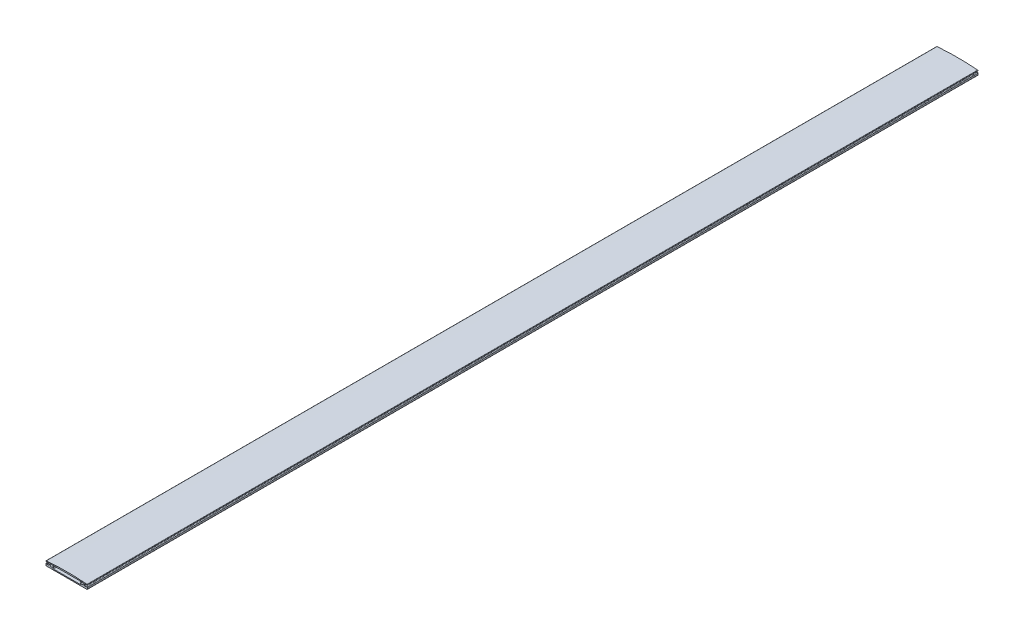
ISO-10303-21;
HEADER;
FILE_DESCRIPTION(('STEP AP214'),'2;1');
FILE_NAME('part.step','',(''),(''),'','','');
FILE_SCHEMA(('AUTOMOTIVE_DESIGN { 1 0 10303 214 1 1 1 1 }'));
ENDSEC;
DATA;
#1=APPLICATION_CONTEXT('core data for automotive mechanical design processes');
#2=APPLICATION_PROTOCOL_DEFINITION('international standard','automotive_design',2000,#1);
#3=PRODUCT_CONTEXT('',#1,'mechanical');
#4=PRODUCT('Part','Part','',(#3));
#5=PRODUCT_RELATED_PRODUCT_CATEGORY('part','',(#4));
#6=PRODUCT_DEFINITION_FORMATION('','',#4);
#7=PRODUCT_DEFINITION_CONTEXT('part definition',#1,'design');
#8=PRODUCT_DEFINITION('design','',#6,#7);
#9=PRODUCT_DEFINITION_SHAPE('','',#8);
#10=(LENGTH_UNIT() NAMED_UNIT(*) SI_UNIT(.MILLI.,.METRE.));
#11=(NAMED_UNIT(*) PLANE_ANGLE_UNIT() SI_UNIT($,.RADIAN.));
#12=(NAMED_UNIT(*) SI_UNIT($,.STERADIAN.) SOLID_ANGLE_UNIT());
#13=UNCERTAINTY_MEASURE_WITH_UNIT(LENGTH_MEASURE(1.E-05),#10,'distance_accuracy_value','');
#14=(GEOMETRIC_REPRESENTATION_CONTEXT(3) GLOBAL_UNCERTAINTY_ASSIGNED_CONTEXT((#13)) GLOBAL_UNIT_ASSIGNED_CONTEXT((#10,
#11,#12)) REPRESENTATION_CONTEXT('',''));
#15=CARTESIAN_POINT('',(0.,0.,0.));
#16=DIRECTION('',(0.,0.,1.));
#17=DIRECTION('',(1.,0.,0.));
#18=AXIS2_PLACEMENT_3D('',#15,#16,#17);
#19=CARTESIAN_POINT('',(24.4987244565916,-0.250000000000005,-711.15));
#20=DIRECTION('',(0.,0.,1.));
#21=DIRECTION('',(1.,0.,0.));
#22=AXIS2_PLACEMENT_3D('',#19,#20,#21);
#23=CYLINDRICAL_SURFACE('',#22,1.6);
#24=CARTESIAN_POINT('',(24.4987244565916,-0.250000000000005,-703.15));
#25=DIRECTION('',(0.,0.,-1.));
#26=DIRECTION('',(-1.,0.,0.));
#27=AXIS2_PLACEMENT_3D('',#24,#25,#26);
#28=CIRCLE('',#27,1.6);
#29=CARTESIAN_POINT('',(23.0853950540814,-1.,-703.15));
#30=VERTEX_POINT('',#29);
#31=CARTESIAN_POINT('',(23.0853950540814,0.499999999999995,-703.15));
#32=VERTEX_POINT('',#31);
#33=EDGE_CURVE('E627',#30,#32,#28,.F.);
#34=ORIENTED_EDGE('',*,*,#33,.F.);
#35=DIRECTION('',(0.,0.,1.));
#36=VECTOR('',#35,1.);
#37=CARTESIAN_POINT('',(23.0853950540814,-1.00000000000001,-711.15));
#38=LINE('',#37,#36);
#39=CARTESIAN_POINT('',(23.0853950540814,-1.00000000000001,701.019956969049));
#40=VERTEX_POINT('',#39);
#41=EDGE_CURVE('E345',#30,#40,#38,.T.);
#42=ORIENTED_EDGE('',*,*,#41,.T.);
#43=CARTESIAN_POINT('',(24.4987244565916,-0.250000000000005,701.019956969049));
#44=DIRECTION('',(0.,0.,1.));
#45=DIRECTION('',(1.,0.,0.));
#46=AXIS2_PLACEMENT_3D('',#43,#44,#45);
#47=CIRCLE('',#46,1.6);
#48=CARTESIAN_POINT('',(23.0853950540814,0.499999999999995,701.019956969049));
#49=VERTEX_POINT('',#48);
#50=EDGE_CURVE('E605',#40,#49,#47,.T.);
#51=ORIENTED_EDGE('',*,*,#50,.T.);
#52=DIRECTION('',(0.,0.,1.));
#53=VECTOR('',#52,1.);
#54=CARTESIAN_POINT('',(23.0853950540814,0.499999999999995,-711.15));
#55=LINE('',#54,#53);
#56=EDGE_CURVE('E358',#32,#49,#55,.T.);
#57=ORIENTED_EDGE('',*,*,#56,.F.);
#58=EDGE_LOOP('',(#34,#42,#51,#57));
#59=FACE_BOUND('',#58,.T.);
#60=ADVANCED_FACE('F16',(#59),#23,.F.);
#61=CARTESIAN_POINT('',(-24.4987244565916,-0.250000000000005,-711.15));
#62=DIRECTION('',(0.,0.,1.));
#63=DIRECTION('',(1.,0.,0.));
#64=AXIS2_PLACEMENT_3D('',#61,#62,#63);
#65=CYLINDRICAL_SURFACE('',#64,1.6);
#66=CARTESIAN_POINT('',(-24.4987244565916,-0.250000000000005,-703.15));
#67=DIRECTION('',(0.,0.,-1.));
#68=DIRECTION('',(-1.,0.,0.));
#69=AXIS2_PLACEMENT_3D('',#66,#67,#68);
#70=CIRCLE('',#69,1.6);
#71=CARTESIAN_POINT('',(-23.0853950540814,0.499999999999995,-703.15));
#72=VERTEX_POINT('',#71);
#73=CARTESIAN_POINT('',(-23.0853950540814,-1.,-703.15));
#74=VERTEX_POINT('',#73);
#75=EDGE_CURVE('E732',#72,#74,#70,.F.);
#76=ORIENTED_EDGE('',*,*,#75,.F.);
#77=DIRECTION('',(0.,0.,1.));
#78=VECTOR('',#77,1.);
#79=CARTESIAN_POINT('',(-23.0853950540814,0.499999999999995,-711.15));
#80=LINE('',#79,#78);
#81=CARTESIAN_POINT('',(-23.0853950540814,0.499999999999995,701.019956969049));
#82=VERTEX_POINT('',#81);
#83=EDGE_CURVE('E696',#72,#82,#80,.T.);
#84=ORIENTED_EDGE('',*,*,#83,.T.);
#85=CARTESIAN_POINT('',(-24.4987244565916,-0.250000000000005,701.019956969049));
#86=DIRECTION('',(0.,0.,1.));
#87=DIRECTION('',(1.,0.,0.));
#88=AXIS2_PLACEMENT_3D('',#85,#86,#87);
#89=CIRCLE('',#88,1.6);
#90=CARTESIAN_POINT('',(-23.0853950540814,-1.,701.019956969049));
#91=VERTEX_POINT('',#90);
#92=EDGE_CURVE('E651',#82,#91,#89,.T.);
#93=ORIENTED_EDGE('',*,*,#92,.T.);
#94=DIRECTION('',(0.,0.,1.));
#95=VECTOR('',#94,1.);
#96=CARTESIAN_POINT('',(-23.0853950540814,-1.,-711.15));
#97=LINE('',#96,#95);
#98=EDGE_CURVE('E698',#74,#91,#97,.T.);
#99=ORIENTED_EDGE('',*,*,#98,.F.);
#100=EDGE_LOOP('',(#76,#84,#93,#99));
#101=FACE_BOUND('',#100,.T.);
#102=ADVANCED_FACE('F617',(#101),#65,.F.);
#103=CARTESIAN_POINT('',(32.4,-4.4,711.15));
#104=DIRECTION('',(0.,0.,-1.));
#105=DIRECTION('',(-1.,0.,0.));
#106=AXIS2_PLACEMENT_3D('',#103,#104,#105);
#107=PLANE('',#106);
#108=DIRECTION('',(1.,0.,0.));
#109=VECTOR('',#108,1.);
#110=CARTESIAN_POINT('',(-22.,-5.,711.15));
#111=LINE('',#110,#109);
#112=CARTESIAN_POINT('',(-32.4,-5.,711.15));
#113=VERTEX_POINT('',#112);
#114=CARTESIAN_POINT('',(32.4,-5.00000000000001,711.15));
#115=VERTEX_POINT('',#114);
#116=EDGE_CURVE('E415',#113,#115,#111,.T.);
#117=ORIENTED_EDGE('',*,*,#116,.T.);
#118=CARTESIAN_POINT('',(32.4,-4.4,711.15));
#119=DIRECTION('',(0.,0.,1.));
#120=DIRECTION('',(-1.,0.,0.));
#121=AXIS2_PLACEMENT_3D('',#118,#119,#120);
#122=CIRCLE('',#121,0.600000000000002);
#123=CARTESIAN_POINT('',(33.,-4.4,711.15));
#124=VERTEX_POINT('',#123);
#125=EDGE_CURVE('E417',#115,#124,#122,.T.);
#126=ORIENTED_EDGE('',*,*,#125,.T.);
#127=DIRECTION('',(0.,1.,0.));
#128=VECTOR('',#127,1.);
#129=CARTESIAN_POINT('',(33.,-4.4,711.15));
#130=LINE('',#129,#128);
#131=CARTESIAN_POINT('',(33.,-2.,711.15));
#132=VERTEX_POINT('',#131);
#133=EDGE_CURVE('E420',#124,#132,#130,.T.);
#134=ORIENTED_EDGE('',*,*,#133,.T.);
#135=CARTESIAN_POINT('',(32.25,-2.,711.15));
#136=DIRECTION('',(0.,0.,1.));
#137=DIRECTION('',(-1.,0.,0.));
#138=AXIS2_PLACEMENT_3D('',#135,#136,#137);
#139=CIRCLE('',#138,0.75);
#140=CARTESIAN_POINT('',(31.5626136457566,-1.7,711.15));
#141=VERTEX_POINT('',#140);
#142=EDGE_CURVE('E422',#132,#141,#139,.T.);
#143=ORIENTED_EDGE('',*,*,#142,.T.);
#144=CARTESIAN_POINT('',(31.104356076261,-1.5,711.15));
#145=DIRECTION('',(0.,0.,-1.));
#146=DIRECTION('',(-1.,0.,0.));
#147=AXIS2_PLACEMENT_3D('',#144,#145,#146);
#148=CIRCLE('',#147,0.500000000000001);
#149=CARTESIAN_POINT('',(31.104356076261,-2.,711.15));
#150=VERTEX_POINT('',#149);
#151=EDGE_CURVE('E424',#141,#150,#148,.T.);
#152=ORIENTED_EDGE('',*,*,#151,.T.);
#153=DIRECTION('',(-1.,0.,0.));
#154=VECTOR('',#153,1.);
#155=CARTESIAN_POINT('',(31.104356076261,-2.,711.15));
#156=LINE('',#155,#154);
#157=CARTESIAN_POINT('',(28.6,-2.,711.15));
#158=VERTEX_POINT('',#157);
#159=EDGE_CURVE('E426',#150,#158,#156,.T.);
#160=ORIENTED_EDGE('',*,*,#159,.T.);
#161=CARTESIAN_POINT('',(28.6,-1.4,711.15));
#162=DIRECTION('',(0.,0.,-1.));
#163=DIRECTION('',(1.,0.,0.));
#164=AXIS2_PLACEMENT_3D('',#161,#162,#163);
#165=CIRCLE('',#164,0.6);
#166=CARTESIAN_POINT('',(28.,-1.4,711.15));
#167=VERTEX_POINT('',#166);
#168=EDGE_CURVE('E428',#158,#167,#165,.T.);
#169=ORIENTED_EDGE('',*,*,#168,.T.);
#170=DIRECTION('',(0.,1.,0.));
#171=VECTOR('',#170,1.);
#172=CARTESIAN_POINT('',(28.,0.149999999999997,711.15));
#173=LINE('',#172,#171);
#174=CARTESIAN_POINT('',(28.,0.149999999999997,711.15));
#175=VERTEX_POINT('',#174);
#176=EDGE_CURVE('E430',#167,#175,#173,.T.);
#177=ORIENTED_EDGE('',*,*,#176,.T.);
#178=CARTESIAN_POINT('',(28.85,0.149999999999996,711.15));
#179=DIRECTION('',(0.,0.,-1.));
#180=DIRECTION('',(-1.,0.,0.));
#181=AXIS2_PLACEMENT_3D('',#178,#179,#180);
#182=CIRCLE('',#181,0.850000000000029);
#183=CARTESIAN_POINT('',(28.85,0.999999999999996,711.15));
#184=VERTEX_POINT('',#183);
#185=EDGE_CURVE('E432',#175,#184,#182,.T.);
#186=ORIENTED_EDGE('',*,*,#185,.T.);
#187=DIRECTION('',(1.,0.,0.));
#188=VECTOR('',#187,1.);
#189=CARTESIAN_POINT('',(32.3999999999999,0.999999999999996,711.15));
#190=LINE('',#189,#188);
#191=CARTESIAN_POINT('',(32.3999999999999,0.999999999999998,711.15));
#192=VERTEX_POINT('',#191);
#193=EDGE_CURVE('E434',#184,#192,#190,.T.);
#194=ORIENTED_EDGE('',*,*,#193,.T.);
#195=CARTESIAN_POINT('',(32.4,1.60048941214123,711.15));
#196=DIRECTION('',(0.,0.,1.));
#197=DIRECTION('',(1.,0.,0.));
#198=AXIS2_PLACEMENT_3D('',#195,#196,#197);
#199=CIRCLE('',#198,0.600489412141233);
#200=CARTESIAN_POINT('',(32.4484386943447,2.19902197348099,711.15));
#201=VERTEX_POINT('',#200);
#202=EDGE_CURVE('E436',#192,#201,#199,.T.);
#203=ORIENTED_EDGE('',*,*,#202,.T.);
#204=CARTESIAN_POINT('',(0.,-398.75,711.15));
#205=DIRECTION('',(0.,0.,1.));
#206=DIRECTION('',(-1.,0.,0.));
#207=AXIS2_PLACEMENT_3D('',#204,#205,#206);
#208=CIRCLE('',#207,402.259890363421);
#209=CARTESIAN_POINT('',(-32.4484386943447,2.19902197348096,711.15));
#210=VERTEX_POINT('',#209);
#211=EDGE_CURVE('E438',#201,#210,#208,.T.);
#212=ORIENTED_EDGE('',*,*,#211,.T.);
#213=CARTESIAN_POINT('',(-32.4,1.60048941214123,711.15));
#214=DIRECTION('',(0.,0.,1.));
#215=DIRECTION('',(-1.,0.,0.));
#216=AXIS2_PLACEMENT_3D('',#213,#214,#215);
#217=CIRCLE('',#216,0.600489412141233);
#218=CARTESIAN_POINT('',(-32.3999999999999,0.999999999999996,711.15));
#219=VERTEX_POINT('',#218);
#220=EDGE_CURVE('E440',#210,#219,#217,.T.);
#221=ORIENTED_EDGE('',*,*,#220,.T.);
#222=DIRECTION('',(1.,0.,0.));
#223=VECTOR('',#222,1.);
#224=CARTESIAN_POINT('',(-32.3999999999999,0.999999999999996,711.15));
#225=LINE('',#224,#223);
#226=CARTESIAN_POINT('',(-28.85,1.00000000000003,711.15));
#227=VERTEX_POINT('',#226);
#228=EDGE_CURVE('E442',#219,#227,#225,.T.);
#229=ORIENTED_EDGE('',*,*,#228,.T.);
#230=CARTESIAN_POINT('',(-28.85,0.149999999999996,711.15));
#231=DIRECTION('',(0.,0.,-1.));
#232=DIRECTION('',(1.,0.,0.));
#233=AXIS2_PLACEMENT_3D('',#230,#231,#232);
#234=CIRCLE('',#233,0.850000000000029);
#235=CARTESIAN_POINT('',(-28.,0.149999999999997,711.15));
#236=VERTEX_POINT('',#235);
#237=EDGE_CURVE('E444',#227,#236,#234,.T.);
#238=ORIENTED_EDGE('',*,*,#237,.T.);
#239=DIRECTION('',(0.,-1.,0.));
#240=VECTOR('',#239,1.);
#241=CARTESIAN_POINT('',(-28.,0.149999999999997,711.15));
#242=LINE('',#241,#240);
#243=CARTESIAN_POINT('',(-28.,-1.4,711.15));
#244=VERTEX_POINT('',#243);
#245=EDGE_CURVE('E446',#236,#244,#242,.T.);
#246=ORIENTED_EDGE('',*,*,#245,.T.);
#247=CARTESIAN_POINT('',(-28.6,-1.4,711.15));
#248=DIRECTION('',(0.,0.,-1.));
#249=DIRECTION('',(-1.,0.,0.));
#250=AXIS2_PLACEMENT_3D('',#247,#248,#249);
#251=CIRCLE('',#250,0.6);
#252=CARTESIAN_POINT('',(-28.6,-2.,711.15));
#253=VERTEX_POINT('',#252);
#254=EDGE_CURVE('E448',#244,#253,#251,.T.);
#255=ORIENTED_EDGE('',*,*,#254,.T.);
#256=DIRECTION('',(-1.,0.,0.));
#257=VECTOR('',#256,1.);
#258=CARTESIAN_POINT('',(-31.104356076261,-2.,711.15));
#259=LINE('',#258,#257);
#260=CARTESIAN_POINT('',(-31.104356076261,-2.,711.15));
#261=VERTEX_POINT('',#260);
#262=EDGE_CURVE('E450',#253,#261,#259,.T.);
#263=ORIENTED_EDGE('',*,*,#262,.T.);
#264=CARTESIAN_POINT('',(-31.104356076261,-1.5,711.15));
#265=DIRECTION('',(0.,0.,-1.));
#266=DIRECTION('',(1.,0.,0.));
#267=AXIS2_PLACEMENT_3D('',#264,#265,#266);
#268=CIRCLE('',#267,0.500000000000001);
#269=CARTESIAN_POINT('',(-31.5626136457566,-1.7,711.15));
#270=VERTEX_POINT('',#269);
#271=EDGE_CURVE('E452',#261,#270,#268,.T.);
#272=ORIENTED_EDGE('',*,*,#271,.T.);
#273=CARTESIAN_POINT('',(-32.25,-2.,711.15));
#274=DIRECTION('',(0.,0.,1.));
#275=DIRECTION('',(1.,0.,0.));
#276=AXIS2_PLACEMENT_3D('',#273,#274,#275);
#277=CIRCLE('',#276,0.75);
#278=CARTESIAN_POINT('',(-33.,-2.,711.15));
#279=VERTEX_POINT('',#278);
#280=EDGE_CURVE('E454',#270,#279,#277,.T.);
#281=ORIENTED_EDGE('',*,*,#280,.T.);
#282=DIRECTION('',(0.,-1.,0.));
#283=VECTOR('',#282,1.);
#284=CARTESIAN_POINT('',(-33.,-4.4,711.15));
#285=LINE('',#284,#283);
#286=CARTESIAN_POINT('',(-33.,-4.4,711.15));
#287=VERTEX_POINT('',#286);
#288=EDGE_CURVE('E456',#279,#287,#285,.T.);
#289=ORIENTED_EDGE('',*,*,#288,.T.);
#290=CARTESIAN_POINT('',(-32.4,-4.4,711.15));
#291=DIRECTION('',(0.,0.,1.));
#292=DIRECTION('',(1.,0.,0.));
#293=AXIS2_PLACEMENT_3D('',#290,#291,#292);
#294=CIRCLE('',#293,0.600000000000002);
#295=EDGE_CURVE('E458',#287,#113,#294,.T.);
#296=ORIENTED_EDGE('',*,*,#295,.T.);
#297=EDGE_LOOP('',(#117,#126,#134,#143,#152,#160,#169,#177,#186,#194,#203,#212,#221,#229,#238,
#246,#255,#263,#272,#281,#289,#296));
#298=FACE_BOUND('',#297,.T.);
#299=CARTESIAN_POINT('',(-24.4987244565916,-0.250000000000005,711.15));
#300=DIRECTION('',(0.,0.,1.));
#301=DIRECTION('',(1.,0.,0.));
#302=AXIS2_PLACEMENT_3D('',#299,#300,#301);
#303=CIRCLE('',#302,1.99999999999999);
#304=CARTESIAN_POINT('',(-22.6446748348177,0.499999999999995,711.15));
#305=VERTEX_POINT('',#304);
#306=CARTESIAN_POINT('',(-22.6446748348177,-1.,711.15));
#307=VERTEX_POINT('',#306);
#308=EDGE_CURVE('E711',#305,#307,#303,.T.);
#309=ORIENTED_EDGE('',*,*,#308,.F.);
#310=DIRECTION('',(-1.,0.,0.));
#311=VECTOR('',#310,1.);
#312=CARTESIAN_POINT('',(-23.0853950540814,0.499999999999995,711.15));
#313=LINE('',#312,#311);
#314=CARTESIAN_POINT('',(-21.9682458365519,0.499999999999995,711.15));
#315=VERTEX_POINT('',#314);
#316=EDGE_CURVE('E604',#315,#305,#313,.T.);
#317=ORIENTED_EDGE('',*,*,#316,.F.);
#318=CARTESIAN_POINT('',(-21.,0.249999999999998,711.15));
#319=DIRECTION('',(0.,0.,1.));
#320=DIRECTION('',(-1.,0.,0.));
#321=AXIS2_PLACEMENT_3D('',#318,#319,#320);
#322=CIRCLE('',#321,1.);
#323=CARTESIAN_POINT('',(-21.,1.25,711.15));
#324=VERTEX_POINT('',#323);
#325=EDGE_CURVE('E361',#324,#315,#322,.T.);
#326=ORIENTED_EDGE('',*,*,#325,.F.);
#327=DIRECTION('',(-1.,0.,0.));
#328=VECTOR('',#327,1.);
#329=CARTESIAN_POINT('',(-21.,1.25,711.15));
#330=LINE('',#329,#328);
#331=CARTESIAN_POINT('',(21.,1.25,711.15));
#332=VERTEX_POINT('',#331);
#333=EDGE_CURVE('E378',#332,#324,#330,.T.);
#334=ORIENTED_EDGE('',*,*,#333,.F.);
#335=CARTESIAN_POINT('',(21.,0.249999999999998,711.15));
#336=DIRECTION('',(0.,0.,1.));
#337=DIRECTION('',(1.,0.,0.));
#338=AXIS2_PLACEMENT_3D('',#335,#336,#337);
#339=CIRCLE('',#338,1.);
#340=CARTESIAN_POINT('',(21.9682458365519,0.499999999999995,711.15));
#341=VERTEX_POINT('',#340);
#342=EDGE_CURVE('E376',#341,#332,#339,.T.);
#343=ORIENTED_EDGE('',*,*,#342,.F.);
#344=DIRECTION('',(-1.,0.,0.));
#345=VECTOR('',#344,1.);
#346=CARTESIAN_POINT('',(23.0853950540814,0.499999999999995,711.15));
#347=LINE('',#346,#345);
#348=CARTESIAN_POINT('',(22.6446748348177,0.499999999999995,711.15));
#349=VERTEX_POINT('',#348);
#350=EDGE_CURVE('E347',#349,#341,#347,.T.);
#351=ORIENTED_EDGE('',*,*,#350,.F.);
#352=CARTESIAN_POINT('',(24.4987244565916,-0.250000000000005,711.15));
#353=DIRECTION('',(0.,0.,1.));
#354=DIRECTION('',(1.,0.,0.));
#355=AXIS2_PLACEMENT_3D('',#352,#353,#354);
#356=CIRCLE('',#355,1.99999999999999);
#357=CARTESIAN_POINT('',(22.6446748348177,-1.,711.15));
#358=VERTEX_POINT('',#357);
#359=EDGE_CURVE('E661',#358,#349,#356,.T.);
#360=ORIENTED_EDGE('',*,*,#359,.F.);
#361=DIRECTION('',(1.,0.,0.));
#362=VECTOR('',#361,1.);
#363=CARTESIAN_POINT('',(23.0853950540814,-1.,711.15));
#364=LINE('',#363,#362);
#365=CARTESIAN_POINT('',(22.,-1.,711.15));
#366=VERTEX_POINT('',#365);
#367=EDGE_CURVE('E351',#366,#358,#364,.T.);
#368=ORIENTED_EDGE('',*,*,#367,.F.);
#369=DIRECTION('',(0.,1.,0.));
#370=VECTOR('',#369,1.);
#371=CARTESIAN_POINT('',(22.,-2.5,711.15));
#372=LINE('',#371,#370);
#373=CARTESIAN_POINT('',(22.,-2.5,711.15));
#374=VERTEX_POINT('',#373);
#375=EDGE_CURVE('E373',#374,#366,#372,.T.);
#376=ORIENTED_EDGE('',*,*,#375,.F.);
#377=CARTESIAN_POINT('',(21.,-2.5,711.15));
#378=DIRECTION('',(0.,0.,1.));
#379=DIRECTION('',(-1.,0.,0.));
#380=AXIS2_PLACEMENT_3D('',#377,#378,#379);
#381=CIRCLE('',#380,1.);
#382=CARTESIAN_POINT('',(21.,-3.5,711.15));
#383=VERTEX_POINT('',#382);
#384=EDGE_CURVE('E371',#383,#374,#381,.T.);
#385=ORIENTED_EDGE('',*,*,#384,.F.);
#386=DIRECTION('',(1.,0.,0.));
#387=VECTOR('',#386,1.);
#388=CARTESIAN_POINT('',(21.,-3.5,711.15));
#389=LINE('',#388,#387);
#390=CARTESIAN_POINT('',(-21.,-3.50000000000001,711.15));
#391=VERTEX_POINT('',#390);
#392=EDGE_CURVE('E369',#391,#383,#389,.T.);
#393=ORIENTED_EDGE('',*,*,#392,.F.);
#394=CARTESIAN_POINT('',(-21.,-2.50000000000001,711.15));
#395=DIRECTION('',(0.,0.,1.));
#396=DIRECTION('',(-1.,0.,0.));
#397=AXIS2_PLACEMENT_3D('',#394,#395,#396);
#398=CIRCLE('',#397,1.);
#399=CARTESIAN_POINT('',(-22.,-2.50000000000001,711.15));
#400=VERTEX_POINT('',#399);
#401=EDGE_CURVE('E367',#400,#391,#398,.T.);
#402=ORIENTED_EDGE('',*,*,#401,.F.);
#403=DIRECTION('',(0.,-1.,0.));
#404=VECTOR('',#403,1.);
#405=CARTESIAN_POINT('',(-22.,-2.50000000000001,711.15));
#406=LINE('',#405,#404);
#407=CARTESIAN_POINT('',(-22.,-1.,711.15));
#408=VERTEX_POINT('',#407);
#409=EDGE_CURVE('E364',#408,#400,#406,.T.);
#410=ORIENTED_EDGE('',*,*,#409,.F.);
#411=DIRECTION('',(1.,0.,0.));
#412=VECTOR('',#411,1.);
#413=CARTESIAN_POINT('',(-23.0853950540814,-1.,711.15));
#414=LINE('',#413,#412);
#415=EDGE_CURVE('E704',#307,#408,#414,.T.);
#416=ORIENTED_EDGE('',*,*,#415,.F.);
#417=EDGE_LOOP('',(#309,#317,#326,#334,#343,#351,#360,#368,#376,#385,#393,#402,#410,#416));
#418=FACE_BOUND('',#417,.T.);
#419=ADVANCED_FACE('F623',(#298,#418),#107,.F.);
#420=CARTESIAN_POINT('',(32.4,-4.4,-711.15));
#421=DIRECTION('',(0.,0.,-1.));
#422=DIRECTION('',(-1.,0.,0.));
#423=AXIS2_PLACEMENT_3D('',#420,#421,#422);
#424=PLANE('',#423);
#425=CARTESIAN_POINT('',(24.4987244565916,-0.250000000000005,-711.15));
#426=DIRECTION('',(0.,0.,-1.));
#427=DIRECTION('',(-1.,0.,0.));
#428=AXIS2_PLACEMENT_3D('',#425,#426,#427);
#429=CIRCLE('',#428,2.);
#430=CARTESIAN_POINT('',(22.6446748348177,0.499999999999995,-711.15));
#431=VERTEX_POINT('',#430);
#432=CARTESIAN_POINT('',(22.6446748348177,-1.,-711.15));
#433=VERTEX_POINT('',#432);
#434=EDGE_CURVE('E323',#431,#433,#429,.T.);
#435=ORIENTED_EDGE('',*,*,#434,.F.);
#436=DIRECTION('',(-1.,0.,0.));
#437=VECTOR('',#436,1.);
#438=CARTESIAN_POINT('',(23.0853950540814,0.499999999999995,-711.15));
#439=LINE('',#438,#437);
#440=CARTESIAN_POINT('',(21.9682458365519,0.499999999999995,-711.15));
#441=VERTEX_POINT('',#440);
#442=EDGE_CURVE('E334',#431,#441,#439,.T.);
#443=ORIENTED_EDGE('',*,*,#442,.T.);
#444=CARTESIAN_POINT('',(21.,0.249999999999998,-711.15));
#445=DIRECTION('',(0.,0.,1.));
#446=DIRECTION('',(1.,0.,0.));
#447=AXIS2_PLACEMENT_3D('',#444,#445,#446);
#448=CIRCLE('',#447,1.);
#449=CARTESIAN_POINT('',(21.,1.25,-711.15));
#450=VERTEX_POINT('',#449);
#451=EDGE_CURVE('E396',#441,#450,#448,.T.);
#452=ORIENTED_EDGE('',*,*,#451,.T.);
#453=DIRECTION('',(-1.,0.,0.));
#454=VECTOR('',#453,1.);
#455=CARTESIAN_POINT('',(-21.,1.25,-711.15));
#456=LINE('',#455,#454);
#457=CARTESIAN_POINT('',(-21.,1.25,-711.15));
#458=VERTEX_POINT('',#457);
#459=EDGE_CURVE('E365',#450,#458,#456,.T.);
#460=ORIENTED_EDGE('',*,*,#459,.T.);
#461=CARTESIAN_POINT('',(-21.,0.249999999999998,-711.15));
#462=DIRECTION('',(0.,0.,1.));
#463=DIRECTION('',(-1.,0.,0.));
#464=AXIS2_PLACEMENT_3D('',#461,#462,#463);
#465=CIRCLE('',#464,1.);
#466=CARTESIAN_POINT('',(-21.9682458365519,0.499999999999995,-711.15));
#467=VERTEX_POINT('',#466);
#468=EDGE_CURVE('E357',#458,#467,#465,.T.);
#469=ORIENTED_EDGE('',*,*,#468,.T.);
#470=DIRECTION('',(-1.,0.,0.));
#471=VECTOR('',#470,1.);
#472=CARTESIAN_POINT('',(-23.0853950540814,0.499999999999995,-711.15));
#473=LINE('',#472,#471);
#474=CARTESIAN_POINT('',(-22.6446748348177,0.499999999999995,-711.15));
#475=VERTEX_POINT('',#474);
#476=EDGE_CURVE('E607',#467,#475,#473,.T.);
#477=ORIENTED_EDGE('',*,*,#476,.T.);
#478=CARTESIAN_POINT('',(-24.4987244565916,-0.250000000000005,-711.15));
#479=DIRECTION('',(0.,0.,-1.));
#480=DIRECTION('',(-1.,0.,0.));
#481=AXIS2_PLACEMENT_3D('',#478,#479,#480);
#482=CIRCLE('',#481,2.);
#483=CARTESIAN_POINT('',(-22.6446748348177,-1.,-711.15));
#484=VERTEX_POINT('',#483);
#485=EDGE_CURVE('E327',#484,#475,#482,.T.);
#486=ORIENTED_EDGE('',*,*,#485,.F.);
#487=DIRECTION('',(1.,0.,0.));
#488=VECTOR('',#487,1.);
#489=CARTESIAN_POINT('',(-23.0853950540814,-1.,-711.15));
#490=LINE('',#489,#488);
#491=CARTESIAN_POINT('',(-22.,-1.,-711.15));
#492=VERTEX_POINT('',#491);
#493=EDGE_CURVE('E697',#484,#492,#490,.T.);
#494=ORIENTED_EDGE('',*,*,#493,.T.);
#495=DIRECTION('',(0.,-1.,0.));
#496=VECTOR('',#495,1.);
#497=CARTESIAN_POINT('',(-22.,-2.50000000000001,-711.15));
#498=LINE('',#497,#496);
#499=CARTESIAN_POINT('',(-22.,-2.50000000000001,-711.15));
#500=VERTEX_POINT('',#499);
#501=EDGE_CURVE('E383',#492,#500,#498,.T.);
#502=ORIENTED_EDGE('',*,*,#501,.T.);
#503=CARTESIAN_POINT('',(-21.,-2.50000000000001,-711.15));
#504=DIRECTION('',(0.,0.,1.));
#505=DIRECTION('',(-1.,0.,0.));
#506=AXIS2_PLACEMENT_3D('',#503,#504,#505);
#507=CIRCLE('',#506,1.);
#508=CARTESIAN_POINT('',(-21.,-3.50000000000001,-711.15));
#509=VERTEX_POINT('',#508);
#510=EDGE_CURVE('E385',#500,#509,#507,.T.);
#511=ORIENTED_EDGE('',*,*,#510,.T.);
#512=DIRECTION('',(1.,0.,0.));
#513=VECTOR('',#512,1.);
#514=CARTESIAN_POINT('',(21.,-3.5,-711.15));
#515=LINE('',#514,#513);
#516=CARTESIAN_POINT('',(21.,-3.5,-711.15));
#517=VERTEX_POINT('',#516);
#518=EDGE_CURVE('E388',#509,#517,#515,.T.);
#519=ORIENTED_EDGE('',*,*,#518,.T.);
#520=CARTESIAN_POINT('',(21.,-2.5,-711.15));
#521=DIRECTION('',(0.,0.,1.));
#522=DIRECTION('',(-1.,0.,0.));
#523=AXIS2_PLACEMENT_3D('',#520,#521,#522);
#524=CIRCLE('',#523,1.);
#525=CARTESIAN_POINT('',(22.,-2.5,-711.15));
#526=VERTEX_POINT('',#525);
#527=EDGE_CURVE('E391',#517,#526,#524,.T.);
#528=ORIENTED_EDGE('',*,*,#527,.T.);
#529=DIRECTION('',(0.,1.,0.));
#530=VECTOR('',#529,1.);
#531=CARTESIAN_POINT('',(22.,-2.5,-711.15));
#532=LINE('',#531,#530);
#533=CARTESIAN_POINT('',(22.,-1.,-711.15));
#534=VERTEX_POINT('',#533);
#535=EDGE_CURVE('E394',#526,#534,#532,.T.);
#536=ORIENTED_EDGE('',*,*,#535,.T.);
#537=DIRECTION('',(1.,0.,0.));
#538=VECTOR('',#537,1.);
#539=CARTESIAN_POINT('',(23.0853950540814,-1.,-711.15));
#540=LINE('',#539,#538);
#541=EDGE_CURVE('E337',#534,#433,#540,.T.);
#542=ORIENTED_EDGE('',*,*,#541,.T.);
#543=EDGE_LOOP('',(#435,#443,#452,#460,#469,#477,#486,#494,#502,#511,#519,#528,#536,#542));
#544=FACE_BOUND('',#543,.T.);
#545=CARTESIAN_POINT('',(32.4,-4.4,-711.15));
#546=DIRECTION('',(0.,0.,1.));
#547=DIRECTION('',(-1.,0.,0.));
#548=AXIS2_PLACEMENT_3D('',#545,#546,#547);
#549=CIRCLE('',#548,0.600000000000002);
#550=CARTESIAN_POINT('',(32.4,-5.00000000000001,-711.15));
#551=VERTEX_POINT('',#550);
#552=CARTESIAN_POINT('',(33.,-4.4,-711.15));
#553=VERTEX_POINT('',#552);
#554=EDGE_CURVE('E414',#551,#553,#549,.T.);
#555=ORIENTED_EDGE('',*,*,#554,.F.);
#556=DIRECTION('',(1.,0.,0.));
#557=VECTOR('',#556,1.);
#558=CARTESIAN_POINT('',(-22.,-5.,-711.15));
#559=LINE('',#558,#557);
#560=CARTESIAN_POINT('',(-32.4,-5.,-711.15));
#561=VERTEX_POINT('',#560);
#562=EDGE_CURVE('E418',#561,#551,#559,.T.);
#563=ORIENTED_EDGE('',*,*,#562,.F.);
#564=CARTESIAN_POINT('',(-32.4,-4.4,-711.15));
#565=DIRECTION('',(0.,0.,1.));
#566=DIRECTION('',(1.,0.,0.));
#567=AXIS2_PLACEMENT_3D('',#564,#565,#566);
#568=CIRCLE('',#567,0.600000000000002);
#569=CARTESIAN_POINT('',(-33.,-4.4,-711.15));
#570=VERTEX_POINT('',#569);
#571=EDGE_CURVE('E501',#570,#561,#568,.T.);
#572=ORIENTED_EDGE('',*,*,#571,.F.);
#573=DIRECTION('',(0.,-1.,0.));
#574=VECTOR('',#573,1.);
#575=CARTESIAN_POINT('',(-33.,-4.4,-711.15));
#576=LINE('',#575,#574);
#577=CARTESIAN_POINT('',(-33.,-2.,-711.15));
#578=VERTEX_POINT('',#577);
#579=EDGE_CURVE('E499',#578,#570,#576,.T.);
#580=ORIENTED_EDGE('',*,*,#579,.F.);
#581=CARTESIAN_POINT('',(-32.25,-2.,-711.15));
#582=DIRECTION('',(0.,0.,1.));
#583=DIRECTION('',(1.,0.,0.));
#584=AXIS2_PLACEMENT_3D('',#581,#582,#583);
#585=CIRCLE('',#584,0.75);
#586=CARTESIAN_POINT('',(-31.5626136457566,-1.7,-711.15));
#587=VERTEX_POINT('',#586);
#588=EDGE_CURVE('E497',#587,#578,#585,.T.);
#589=ORIENTED_EDGE('',*,*,#588,.F.);
#590=CARTESIAN_POINT('',(-31.104356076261,-1.5,-711.15));
#591=DIRECTION('',(0.,0.,-1.));
#592=DIRECTION('',(1.,0.,0.));
#593=AXIS2_PLACEMENT_3D('',#590,#591,#592);
#594=CIRCLE('',#593,0.500000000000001);
#595=CARTESIAN_POINT('',(-31.104356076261,-2.,-711.15));
#596=VERTEX_POINT('',#595);
#597=EDGE_CURVE('E495',#596,#587,#594,.T.);
#598=ORIENTED_EDGE('',*,*,#597,.F.);
#599=DIRECTION('',(-1.,0.,0.));
#600=VECTOR('',#599,1.);
#601=CARTESIAN_POINT('',(-31.104356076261,-2.,-711.15));
#602=LINE('',#601,#600);
#603=CARTESIAN_POINT('',(-28.6,-2.,-711.15));
#604=VERTEX_POINT('',#603);
#605=EDGE_CURVE('E493',#604,#596,#602,.T.);
#606=ORIENTED_EDGE('',*,*,#605,.F.);
#607=CARTESIAN_POINT('',(-28.6,-1.4,-711.15));
#608=DIRECTION('',(0.,0.,-1.));
#609=DIRECTION('',(-1.,0.,0.));
#610=AXIS2_PLACEMENT_3D('',#607,#608,#609);
#611=CIRCLE('',#610,0.6);
#612=CARTESIAN_POINT('',(-28.,-1.4,-711.15));
#613=VERTEX_POINT('',#612);
#614=EDGE_CURVE('E491',#613,#604,#611,.T.);
#615=ORIENTED_EDGE('',*,*,#614,.F.);
#616=DIRECTION('',(0.,-1.,0.));
#617=VECTOR('',#616,1.);
#618=CARTESIAN_POINT('',(-28.,0.149999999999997,-711.15));
#619=LINE('',#618,#617);
#620=CARTESIAN_POINT('',(-28.,0.149999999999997,-711.15));
#621=VERTEX_POINT('',#620);
#622=EDGE_CURVE('E489',#621,#613,#619,.T.);
#623=ORIENTED_EDGE('',*,*,#622,.F.);
#624=CARTESIAN_POINT('',(-28.85,0.149999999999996,-711.15));
#625=DIRECTION('',(0.,0.,-1.));
#626=DIRECTION('',(1.,0.,0.));
#627=AXIS2_PLACEMENT_3D('',#624,#625,#626);
#628=CIRCLE('',#627,0.850000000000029);
#629=CARTESIAN_POINT('',(-28.85,1.00000000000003,-711.15));
#630=VERTEX_POINT('',#629);
#631=EDGE_CURVE('E487',#630,#621,#628,.T.);
#632=ORIENTED_EDGE('',*,*,#631,.F.);
#633=DIRECTION('',(1.,0.,0.));
#634=VECTOR('',#633,1.);
#635=CARTESIAN_POINT('',(-32.3999999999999,0.999999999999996,-711.15));
#636=LINE('',#635,#634);
#637=CARTESIAN_POINT('',(-32.3999999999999,0.999999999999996,-711.15));
#638=VERTEX_POINT('',#637);
#639=EDGE_CURVE('E485',#638,#630,#636,.T.);
#640=ORIENTED_EDGE('',*,*,#639,.F.);
#641=CARTESIAN_POINT('',(-32.4,1.60048941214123,-711.15));
#642=DIRECTION('',(0.,0.,1.));
#643=DIRECTION('',(-1.,0.,0.));
#644=AXIS2_PLACEMENT_3D('',#641,#642,#643);
#645=CIRCLE('',#644,0.600489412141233);
#646=CARTESIAN_POINT('',(-32.4484386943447,2.19902197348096,-711.15));
#647=VERTEX_POINT('',#646);
#648=EDGE_CURVE('E483',#647,#638,#645,.T.);
#649=ORIENTED_EDGE('',*,*,#648,.F.);
#650=CARTESIAN_POINT('',(0.,-398.75,-711.15));
#651=DIRECTION('',(0.,0.,1.));
#652=DIRECTION('',(-1.,0.,0.));
#653=AXIS2_PLACEMENT_3D('',#650,#651,#652);
#654=CIRCLE('',#653,402.259890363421);
#655=CARTESIAN_POINT('',(32.4484386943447,2.19902197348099,-711.15));
#656=VERTEX_POINT('',#655);
#657=EDGE_CURVE('E481',#656,#647,#654,.T.);
#658=ORIENTED_EDGE('',*,*,#657,.F.);
#659=CARTESIAN_POINT('',(32.4,1.60048941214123,-711.15));
#660=DIRECTION('',(0.,0.,1.));
#661=DIRECTION('',(1.,0.,0.));
#662=AXIS2_PLACEMENT_3D('',#659,#660,#661);
#663=CIRCLE('',#662,0.600489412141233);
#664=CARTESIAN_POINT('',(32.3999999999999,0.999999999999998,-711.15));
#665=VERTEX_POINT('',#664);
#666=EDGE_CURVE('E479',#665,#656,#663,.T.);
#667=ORIENTED_EDGE('',*,*,#666,.F.);
#668=DIRECTION('',(1.,0.,0.));
#669=VECTOR('',#668,1.);
#670=CARTESIAN_POINT('',(32.3999999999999,0.999999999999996,-711.15));
#671=LINE('',#670,#669);
#672=CARTESIAN_POINT('',(28.85,0.999999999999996,-711.15));
#673=VERTEX_POINT('',#672);
#674=EDGE_CURVE('E477',#673,#665,#671,.T.);
#675=ORIENTED_EDGE('',*,*,#674,.F.);
#676=CARTESIAN_POINT('',(28.85,0.149999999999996,-711.15));
#677=DIRECTION('',(0.,0.,-1.));
#678=DIRECTION('',(-1.,0.,0.));
#679=AXIS2_PLACEMENT_3D('',#676,#677,#678);
#680=CIRCLE('',#679,0.850000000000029);
#681=CARTESIAN_POINT('',(28.,0.149999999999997,-711.15));
#682=VERTEX_POINT('',#681);
#683=EDGE_CURVE('E475',#682,#673,#680,.T.);
#684=ORIENTED_EDGE('',*,*,#683,.F.);
#685=DIRECTION('',(0.,1.,0.));
#686=VECTOR('',#685,1.);
#687=CARTESIAN_POINT('',(28.,0.149999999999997,-711.15));
#688=LINE('',#687,#686);
#689=CARTESIAN_POINT('',(28.,-1.4,-711.15));
#690=VERTEX_POINT('',#689);
#691=EDGE_CURVE('E473',#690,#682,#688,.T.);
#692=ORIENTED_EDGE('',*,*,#691,.F.);
#693=CARTESIAN_POINT('',(28.6,-1.4,-711.15));
#694=DIRECTION('',(0.,0.,-1.));
#695=DIRECTION('',(1.,0.,0.));
#696=AXIS2_PLACEMENT_3D('',#693,#694,#695);
#697=CIRCLE('',#696,0.6);
#698=CARTESIAN_POINT('',(28.6,-2.,-711.15));
#699=VERTEX_POINT('',#698);
#700=EDGE_CURVE('E471',#699,#690,#697,.T.);
#701=ORIENTED_EDGE('',*,*,#700,.F.);
#702=DIRECTION('',(-1.,0.,0.));
#703=VECTOR('',#702,1.);
#704=CARTESIAN_POINT('',(31.104356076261,-2.,-711.15));
#705=LINE('',#704,#703);
#706=CARTESIAN_POINT('',(31.104356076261,-2.,-711.15));
#707=VERTEX_POINT('',#706);
#708=EDGE_CURVE('E469',#707,#699,#705,.T.);
#709=ORIENTED_EDGE('',*,*,#708,.F.);
#710=CARTESIAN_POINT('',(31.104356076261,-1.5,-711.15));
#711=DIRECTION('',(0.,0.,-1.));
#712=DIRECTION('',(-1.,0.,0.));
#713=AXIS2_PLACEMENT_3D('',#710,#711,#712);
#714=CIRCLE('',#713,0.500000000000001);
#715=CARTESIAN_POINT('',(31.5626136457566,-1.7,-711.15));
#716=VERTEX_POINT('',#715);
#717=EDGE_CURVE('E467',#716,#707,#714,.T.);
#718=ORIENTED_EDGE('',*,*,#717,.F.);
#719=CARTESIAN_POINT('',(32.25,-2.,-711.15));
#720=DIRECTION('',(0.,0.,1.));
#721=DIRECTION('',(-1.,0.,0.));
#722=AXIS2_PLACEMENT_3D('',#719,#720,#721);
#723=CIRCLE('',#722,0.75);
#724=CARTESIAN_POINT('',(33.,-2.,-711.15));
#725=VERTEX_POINT('',#724);
#726=EDGE_CURVE('E465',#725,#716,#723,.T.);
#727=ORIENTED_EDGE('',*,*,#726,.F.);
#728=DIRECTION('',(0.,1.,0.));
#729=VECTOR('',#728,1.);
#730=CARTESIAN_POINT('',(33.,-4.4,-711.15));
#731=LINE('',#730,#729);
#732=EDGE_CURVE('E463',#553,#725,#731,.T.);
#733=ORIENTED_EDGE('',*,*,#732,.F.);
#734=EDGE_LOOP('',(#555,#563,#572,#580,#589,#598,#606,#615,#623,#632,#640,#649,#658,#667,#675,
#684,#692,#701,#709,#718,#727,#733));
#735=FACE_BOUND('',#734,.T.);
#736=ADVANCED_FACE('F332',(#544,#735),#424,.T.);
#737=CARTESIAN_POINT('',(32.4,-4.4,711.15));
#738=DIRECTION('',(0.,0.,-1.));
#739=DIRECTION('',(-1.,0.,0.));
#740=AXIS2_PLACEMENT_3D('',#737,#738,#739);
#741=CYLINDRICAL_SURFACE('',#740,0.600000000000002);
#742=ORIENTED_EDGE('',*,*,#554,.T.);
#743=DIRECTION('',(0.,0.,-1.));
#744=VECTOR('',#743,1.);
#745=CARTESIAN_POINT('',(33.,-4.4,711.15));
#746=LINE('',#745,#744);
#747=EDGE_CURVE('E563',#124,#553,#746,.T.);
#748=ORIENTED_EDGE('',*,*,#747,.F.);
#749=ORIENTED_EDGE('',*,*,#125,.F.);
#750=DIRECTION('',(0.,0.,-1.));
#751=VECTOR('',#750,1.);
#752=CARTESIAN_POINT('',(32.4,-5.00000000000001,711.15));
#753=LINE('',#752,#751);
#754=EDGE_CURVE('E566',#115,#551,#753,.T.);
#755=ORIENTED_EDGE('',*,*,#754,.T.);
#756=EDGE_LOOP('',(#742,#748,#749,#755));
#757=FACE_BOUND('',#756,.T.);
#758=ADVANCED_FACE('F18',(#757),#741,.T.);
#759=CARTESIAN_POINT('',(33.,-4.4,711.15));
#760=DIRECTION('',(-1.,0.,0.));
#761=DIRECTION('',(0.,-1.,0.));
#762=AXIS2_PLACEMENT_3D('',#759,#760,#761);
#763=PLANE('',#762);
#764=ORIENTED_EDGE('',*,*,#732,.T.);
#765=DIRECTION('',(0.,0.,-1.));
#766=VECTOR('',#765,1.);
#767=CARTESIAN_POINT('',(33.,-2.,711.15));
#768=LINE('',#767,#766);
#769=EDGE_CURVE('E560',#132,#725,#768,.T.);
#770=ORIENTED_EDGE('',*,*,#769,.F.);
#771=ORIENTED_EDGE('',*,*,#133,.F.);
#772=ORIENTED_EDGE('',*,*,#747,.T.);
#773=EDGE_LOOP('',(#764,#770,#771,#772));
#774=FACE_BOUND('',#773,.T.);
#775=ADVANCED_FACE('F1073',(#774),#763,.F.);
#776=CARTESIAN_POINT('',(32.25,-2.,711.15));
#777=DIRECTION('',(0.,0.,-1.));
#778=DIRECTION('',(-1.,0.,0.));
#779=AXIS2_PLACEMENT_3D('',#776,#777,#778);
#780=CYLINDRICAL_SURFACE('',#779,0.75);
#781=ORIENTED_EDGE('',*,*,#726,.T.);
#782=DIRECTION('',(0.,0.,-1.));
#783=VECTOR('',#782,1.);
#784=CARTESIAN_POINT('',(31.5626136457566,-1.7,711.15));
#785=LINE('',#784,#783);
#786=EDGE_CURVE('E557',#141,#716,#785,.T.);
#787=ORIENTED_EDGE('',*,*,#786,.F.);
#788=ORIENTED_EDGE('',*,*,#142,.F.);
#789=ORIENTED_EDGE('',*,*,#769,.T.);
#790=EDGE_LOOP('',(#781,#787,#788,#789));
#791=FACE_BOUND('',#790,.T.);
#792=ADVANCED_FACE('F1064',(#791),#780,.T.);
#793=CARTESIAN_POINT('',(31.104356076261,-1.5,711.15));
#794=DIRECTION('',(0.,0.,-1.));
#795=DIRECTION('',(-1.,0.,0.));
#796=AXIS2_PLACEMENT_3D('',#793,#794,#795);
#797=CYLINDRICAL_SURFACE('',#796,0.500000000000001);
#798=ORIENTED_EDGE('',*,*,#717,.T.);
#799=DIRECTION('',(0.,0.,-1.));
#800=VECTOR('',#799,1.);
#801=CARTESIAN_POINT('',(31.104356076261,-2.,711.15));
#802=LINE('',#801,#800);
#803=EDGE_CURVE('E554',#150,#707,#802,.T.);
#804=ORIENTED_EDGE('',*,*,#803,.F.);
#805=ORIENTED_EDGE('',*,*,#151,.F.);
#806=ORIENTED_EDGE('',*,*,#786,.T.);
#807=EDGE_LOOP('',(#798,#804,#805,#806));
#808=FACE_BOUND('',#807,.T.);
#809=ADVANCED_FACE('F1055',(#808),#797,.F.);
#810=CARTESIAN_POINT('',(31.104356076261,-2.,711.15));
#811=DIRECTION('',(0.,-1.,0.));
#812=DIRECTION('',(1.,0.,0.));
#813=AXIS2_PLACEMENT_3D('',#810,#811,#812);
#814=PLANE('',#813);
#815=ORIENTED_EDGE('',*,*,#708,.T.);
#816=DIRECTION('',(0.,0.,-1.));
#817=VECTOR('',#816,1.);
#818=CARTESIAN_POINT('',(28.6,-2.,711.15));
#819=LINE('',#818,#817);
#820=EDGE_CURVE('E551',#158,#699,#819,.T.);
#821=ORIENTED_EDGE('',*,*,#820,.F.);
#822=ORIENTED_EDGE('',*,*,#159,.F.);
#823=ORIENTED_EDGE('',*,*,#803,.T.);
#824=EDGE_LOOP('',(#815,#821,#822,#823));
#825=FACE_BOUND('',#824,.T.);
#826=ADVANCED_FACE('F1046',(#825),#814,.F.);
#827=CARTESIAN_POINT('',(28.6,-1.4,711.15));
#828=DIRECTION('',(0.,0.,-1.));
#829=DIRECTION('',(-1.,0.,0.));
#830=AXIS2_PLACEMENT_3D('',#827,#828,#829);
#831=CYLINDRICAL_SURFACE('',#830,0.6);
#832=ORIENTED_EDGE('',*,*,#700,.T.);
#833=DIRECTION('',(0.,0.,-1.));
#834=VECTOR('',#833,1.);
#835=CARTESIAN_POINT('',(28.,-1.4,711.15));
#836=LINE('',#835,#834);
#837=EDGE_CURVE('E548',#167,#690,#836,.T.);
#838=ORIENTED_EDGE('',*,*,#837,.F.);
#839=ORIENTED_EDGE('',*,*,#168,.F.);
#840=ORIENTED_EDGE('',*,*,#820,.T.);
#841=EDGE_LOOP('',(#832,#838,#839,#840));
#842=FACE_BOUND('',#841,.T.);
#843=ADVANCED_FACE('F1037',(#842),#831,.F.);
#844=CARTESIAN_POINT('',(28.,0.149999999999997,711.15));
#845=DIRECTION('',(-1.,0.,0.));
#846=DIRECTION('',(0.,-1.,0.));
#847=AXIS2_PLACEMENT_3D('',#844,#845,#846);
#848=PLANE('',#847);
#849=ORIENTED_EDGE('',*,*,#691,.T.);
#850=DIRECTION('',(0.,0.,-1.));
#851=VECTOR('',#850,1.);
#852=CARTESIAN_POINT('',(28.,0.149999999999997,711.15));
#853=LINE('',#852,#851);
#854=EDGE_CURVE('E545',#175,#682,#853,.T.);
#855=ORIENTED_EDGE('',*,*,#854,.F.);
#856=ORIENTED_EDGE('',*,*,#176,.F.);
#857=ORIENTED_EDGE('',*,*,#837,.T.);
#858=EDGE_LOOP('',(#849,#855,#856,#857));
#859=FACE_BOUND('',#858,.T.);
#860=ADVANCED_FACE('F1028',(#859),#848,.F.);
#861=CARTESIAN_POINT('',(28.85,0.149999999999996,711.15));
#862=DIRECTION('',(0.,0.,-1.));
#863=DIRECTION('',(-1.,0.,0.));
#864=AXIS2_PLACEMENT_3D('',#861,#862,#863);
#865=CYLINDRICAL_SURFACE('',#864,0.850000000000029);
#866=ORIENTED_EDGE('',*,*,#683,.T.);
#867=DIRECTION('',(0.,0.,-1.));
#868=VECTOR('',#867,1.);
#869=CARTESIAN_POINT('',(28.85,0.999999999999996,711.15));
#870=LINE('',#869,#868);
#871=EDGE_CURVE('E542',#184,#673,#870,.T.);
#872=ORIENTED_EDGE('',*,*,#871,.F.);
#873=ORIENTED_EDGE('',*,*,#185,.F.);
#874=ORIENTED_EDGE('',*,*,#854,.T.);
#875=EDGE_LOOP('',(#866,#872,#873,#874));
#876=FACE_BOUND('',#875,.T.);
#877=ADVANCED_FACE('F1019',(#876),#865,.F.);
#878=CARTESIAN_POINT('',(32.3999999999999,0.999999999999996,711.15));
#879=DIRECTION('',(0.,1.,0.));
#880=DIRECTION('',(0.,0.,1.));
#881=AXIS2_PLACEMENT_3D('',#878,#879,#880);
#882=PLANE('',#881);
#883=ORIENTED_EDGE('',*,*,#674,.T.);
#884=DIRECTION('',(0.,0.,-1.));
#885=VECTOR('',#884,1.);
#886=CARTESIAN_POINT('',(32.3999999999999,0.999999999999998,711.15));
#887=LINE('',#886,#885);
#888=EDGE_CURVE('E539',#192,#665,#887,.T.);
#889=ORIENTED_EDGE('',*,*,#888,.F.);
#890=ORIENTED_EDGE('',*,*,#193,.F.);
#891=ORIENTED_EDGE('',*,*,#871,.T.);
#892=EDGE_LOOP('',(#883,#889,#890,#891));
#893=FACE_BOUND('',#892,.T.);
#894=ADVANCED_FACE('F1010',(#893),#882,.F.);
#895=CARTESIAN_POINT('',(32.4,1.60048941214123,711.15));
#896=DIRECTION('',(0.,0.,-1.));
#897=DIRECTION('',(-1.,0.,0.));
#898=AXIS2_PLACEMENT_3D('',#895,#896,#897);
#899=CYLINDRICAL_SURFACE('',#898,0.600489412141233);
#900=ORIENTED_EDGE('',*,*,#666,.T.);
#901=DIRECTION('',(0.,0.,-1.));
#902=VECTOR('',#901,1.);
#903=CARTESIAN_POINT('',(32.4484386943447,2.19902197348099,711.15));
#904=LINE('',#903,#902);
#905=EDGE_CURVE('E536',#201,#656,#904,.T.);
#906=ORIENTED_EDGE('',*,*,#905,.F.);
#907=ORIENTED_EDGE('',*,*,#202,.F.);
#908=ORIENTED_EDGE('',*,*,#888,.T.);
#909=EDGE_LOOP('',(#900,#906,#907,#908));
#910=FACE_BOUND('',#909,.T.);
#911=ADVANCED_FACE('F1001',(#910),#899,.T.);
#912=CARTESIAN_POINT('',(0.,-398.75,711.15));
#913=DIRECTION('',(0.,0.,-1.));
#914=DIRECTION('',(-1.,0.,0.));
#915=AXIS2_PLACEMENT_3D('',#912,#913,#914);
#916=CYLINDRICAL_SURFACE('',#915,402.259890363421);
#917=ORIENTED_EDGE('',*,*,#657,.T.);
#918=DIRECTION('',(0.,0.,-1.));
#919=VECTOR('',#918,1.);
#920=CARTESIAN_POINT('',(-32.4484386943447,2.19902197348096,711.15));
#921=LINE('',#920,#919);
#922=EDGE_CURVE('E533',#210,#647,#921,.T.);
#923=ORIENTED_EDGE('',*,*,#922,.F.);
#924=ORIENTED_EDGE('',*,*,#211,.F.);
#925=ORIENTED_EDGE('',*,*,#905,.T.);
#926=EDGE_LOOP('',(#917,#923,#924,#925));
#927=FACE_BOUND('',#926,.T.);
#928=ADVANCED_FACE('F992',(#927),#916,.T.);
#929=CARTESIAN_POINT('',(-32.4,1.60048941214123,711.15));
#930=DIRECTION('',(0.,0.,-1.));
#931=DIRECTION('',(-1.,0.,0.));
#932=AXIS2_PLACEMENT_3D('',#929,#930,#931);
#933=CYLINDRICAL_SURFACE('',#932,0.600489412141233);
#934=ORIENTED_EDGE('',*,*,#648,.T.);
#935=DIRECTION('',(0.,0.,-1.));
#936=VECTOR('',#935,1.);
#937=CARTESIAN_POINT('',(-32.3999999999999,0.999999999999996,711.15));
#938=LINE('',#937,#936);
#939=EDGE_CURVE('E530',#219,#638,#938,.T.);
#940=ORIENTED_EDGE('',*,*,#939,.F.);
#941=ORIENTED_EDGE('',*,*,#220,.F.);
#942=ORIENTED_EDGE('',*,*,#922,.T.);
#943=EDGE_LOOP('',(#934,#940,#941,#942));
#944=FACE_BOUND('',#943,.T.);
#945=ADVANCED_FACE('F983',(#944),#933,.T.);
#946=CARTESIAN_POINT('',(-32.3999999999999,0.999999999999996,711.15));
#947=DIRECTION('',(0.,1.,0.));
#948=DIRECTION('',(0.,0.,1.));
#949=AXIS2_PLACEMENT_3D('',#946,#947,#948);
#950=PLANE('',#949);
#951=ORIENTED_EDGE('',*,*,#639,.T.);
#952=DIRECTION('',(0.,0.,-1.));
#953=VECTOR('',#952,1.);
#954=CARTESIAN_POINT('',(-28.85,1.00000000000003,711.15));
#955=LINE('',#954,#953);
#956=EDGE_CURVE('E527',#227,#630,#955,.T.);
#957=ORIENTED_EDGE('',*,*,#956,.F.);
#958=ORIENTED_EDGE('',*,*,#228,.F.);
#959=ORIENTED_EDGE('',*,*,#939,.T.);
#960=EDGE_LOOP('',(#951,#957,#958,#959));
#961=FACE_BOUND('',#960,.T.);
#962=ADVANCED_FACE('F974',(#961),#950,.F.);
#963=CARTESIAN_POINT('',(-28.85,0.149999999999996,711.15));
#964=DIRECTION('',(0.,0.,-1.));
#965=DIRECTION('',(-1.,0.,0.));
#966=AXIS2_PLACEMENT_3D('',#963,#964,#965);
#967=CYLINDRICAL_SURFACE('',#966,0.850000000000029);
#968=ORIENTED_EDGE('',*,*,#631,.T.);
#969=DIRECTION('',(0.,0.,-1.));
#970=VECTOR('',#969,1.);
#971=CARTESIAN_POINT('',(-28.,0.149999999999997,711.15));
#972=LINE('',#971,#970);
#973=EDGE_CURVE('E524',#236,#621,#972,.T.);
#974=ORIENTED_EDGE('',*,*,#973,.F.);
#975=ORIENTED_EDGE('',*,*,#237,.F.);
#976=ORIENTED_EDGE('',*,*,#956,.T.);
#977=EDGE_LOOP('',(#968,#974,#975,#976));
#978=FACE_BOUND('',#977,.T.);
#979=ADVANCED_FACE('F965',(#978),#967,.F.);
#980=CARTESIAN_POINT('',(-28.,0.149999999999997,711.15));
#981=DIRECTION('',(1.,0.,0.));
#982=DIRECTION('',(0.,1.,0.));
#983=AXIS2_PLACEMENT_3D('',#980,#981,#982);
#984=PLANE('',#983);
#985=ORIENTED_EDGE('',*,*,#622,.T.);
#986=DIRECTION('',(0.,0.,-1.));
#987=VECTOR('',#986,1.);
#988=CARTESIAN_POINT('',(-28.,-1.4,711.15));
#989=LINE('',#988,#987);
#990=EDGE_CURVE('E521',#244,#613,#989,.T.);
#991=ORIENTED_EDGE('',*,*,#990,.F.);
#992=ORIENTED_EDGE('',*,*,#245,.F.);
#993=ORIENTED_EDGE('',*,*,#973,.T.);
#994=EDGE_LOOP('',(#985,#991,#992,#993));
#995=FACE_BOUND('',#994,.T.);
#996=ADVANCED_FACE('F956',(#995),#984,.F.);
#997=CARTESIAN_POINT('',(-28.6,-1.4,711.15));
#998=DIRECTION('',(0.,0.,-1.));
#999=DIRECTION('',(-1.,0.,0.));
#1000=AXIS2_PLACEMENT_3D('',#997,#998,#999);
#1001=CYLINDRICAL_SURFACE('',#1000,0.6);
#1002=ORIENTED_EDGE('',*,*,#614,.T.);
#1003=DIRECTION('',(0.,0.,-1.));
#1004=VECTOR('',#1003,1.);
#1005=CARTESIAN_POINT('',(-28.6,-2.,711.15));
#1006=LINE('',#1005,#1004);
#1007=EDGE_CURVE('E518',#253,#604,#1006,.T.);
#1008=ORIENTED_EDGE('',*,*,#1007,.F.);
#1009=ORIENTED_EDGE('',*,*,#254,.F.);
#1010=ORIENTED_EDGE('',*,*,#990,.T.);
#1011=EDGE_LOOP('',(#1002,#1008,#1009,#1010));
#1012=FACE_BOUND('',#1011,.T.);
#1013=ADVANCED_FACE('F947',(#1012),#1001,.F.);
#1014=CARTESIAN_POINT('',(-31.104356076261,-2.,711.15));
#1015=DIRECTION('',(0.,-1.,0.));
#1016=DIRECTION('',(1.,0.,0.));
#1017=AXIS2_PLACEMENT_3D('',#1014,#1015,#1016);
#1018=PLANE('',#1017);
#1019=ORIENTED_EDGE('',*,*,#605,.T.);
#1020=DIRECTION('',(0.,0.,-1.));
#1021=VECTOR('',#1020,1.);
#1022=CARTESIAN_POINT('',(-31.104356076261,-2.,711.15));
#1023=LINE('',#1022,#1021);
#1024=EDGE_CURVE('E515',#261,#596,#1023,.T.);
#1025=ORIENTED_EDGE('',*,*,#1024,.F.);
#1026=ORIENTED_EDGE('',*,*,#262,.F.);
#1027=ORIENTED_EDGE('',*,*,#1007,.T.);
#1028=EDGE_LOOP('',(#1019,#1025,#1026,#1027));
#1029=FACE_BOUND('',#1028,.T.);
#1030=ADVANCED_FACE('F938',(#1029),#1018,.F.);
#1031=CARTESIAN_POINT('',(-31.104356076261,-1.5,711.15));
#1032=DIRECTION('',(0.,0.,-1.));
#1033=DIRECTION('',(-1.,0.,0.));
#1034=AXIS2_PLACEMENT_3D('',#1031,#1032,#1033);
#1035=CYLINDRICAL_SURFACE('',#1034,0.500000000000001);
#1036=ORIENTED_EDGE('',*,*,#597,.T.);
#1037=DIRECTION('',(0.,0.,-1.));
#1038=VECTOR('',#1037,1.);
#1039=CARTESIAN_POINT('',(-31.5626136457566,-1.7,711.15));
#1040=LINE('',#1039,#1038);
#1041=EDGE_CURVE('E512',#270,#587,#1040,.T.);
#1042=ORIENTED_EDGE('',*,*,#1041,.F.);
#1043=ORIENTED_EDGE('',*,*,#271,.F.);
#1044=ORIENTED_EDGE('',*,*,#1024,.T.);
#1045=EDGE_LOOP('',(#1036,#1042,#1043,#1044));
#1046=FACE_BOUND('',#1045,.T.);
#1047=ADVANCED_FACE('F929',(#1046),#1035,.F.);
#1048=CARTESIAN_POINT('',(-32.25,-2.,711.15));
#1049=DIRECTION('',(0.,0.,-1.));
#1050=DIRECTION('',(-1.,0.,0.));
#1051=AXIS2_PLACEMENT_3D('',#1048,#1049,#1050);
#1052=CYLINDRICAL_SURFACE('',#1051,0.75);
#1053=ORIENTED_EDGE('',*,*,#588,.T.);
#1054=DIRECTION('',(0.,0.,-1.));
#1055=VECTOR('',#1054,1.);
#1056=CARTESIAN_POINT('',(-33.,-2.,711.15));
#1057=LINE('',#1056,#1055);
#1058=EDGE_CURVE('E509',#279,#578,#1057,.T.);
#1059=ORIENTED_EDGE('',*,*,#1058,.F.);
#1060=ORIENTED_EDGE('',*,*,#280,.F.);
#1061=ORIENTED_EDGE('',*,*,#1041,.T.);
#1062=EDGE_LOOP('',(#1053,#1059,#1060,#1061));
#1063=FACE_BOUND('',#1062,.T.);
#1064=ADVANCED_FACE('F920',(#1063),#1052,.T.);
#1065=CARTESIAN_POINT('',(-33.,-4.4,711.15));
#1066=DIRECTION('',(1.,0.,0.));
#1067=DIRECTION('',(0.,1.,0.));
#1068=AXIS2_PLACEMENT_3D('',#1065,#1066,#1067);
#1069=PLANE('',#1068);
#1070=ORIENTED_EDGE('',*,*,#579,.T.);
#1071=DIRECTION('',(0.,0.,-1.));
#1072=VECTOR('',#1071,1.);
#1073=CARTESIAN_POINT('',(-33.,-4.4,711.15));
#1074=LINE('',#1073,#1072);
#1075=EDGE_CURVE('E506',#287,#570,#1074,.T.);
#1076=ORIENTED_EDGE('',*,*,#1075,.F.);
#1077=ORIENTED_EDGE('',*,*,#288,.F.);
#1078=ORIENTED_EDGE('',*,*,#1058,.T.);
#1079=EDGE_LOOP('',(#1070,#1076,#1077,#1078));
#1080=FACE_BOUND('',#1079,.T.);
#1081=ADVANCED_FACE('F911',(#1080),#1069,.F.);
#1082=CARTESIAN_POINT('',(-32.4,-4.4,711.15));
#1083=DIRECTION('',(0.,0.,-1.));
#1084=DIRECTION('',(-1.,0.,0.));
#1085=AXIS2_PLACEMENT_3D('',#1082,#1083,#1084);
#1086=CYLINDRICAL_SURFACE('',#1085,0.600000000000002);
#1087=ORIENTED_EDGE('',*,*,#571,.T.);
#1088=DIRECTION('',(0.,0.,-1.));
#1089=VECTOR('',#1088,1.);
#1090=CARTESIAN_POINT('',(-32.4,-5.,711.15));
#1091=LINE('',#1090,#1089);
#1092=EDGE_CURVE('E461',#113,#561,#1091,.T.);
#1093=ORIENTED_EDGE('',*,*,#1092,.F.);
#1094=ORIENTED_EDGE('',*,*,#295,.F.);
#1095=ORIENTED_EDGE('',*,*,#1075,.T.);
#1096=EDGE_LOOP('',(#1087,#1093,#1094,#1095));
#1097=FACE_BOUND('',#1096,.T.);
#1098=ADVANCED_FACE('F902',(#1097),#1086,.T.);
#1099=CARTESIAN_POINT('',(-22.,-5.,711.15));
#1100=DIRECTION('',(0.,1.,0.));
#1101=DIRECTION('',(-1.,0.,0.));
#1102=AXIS2_PLACEMENT_3D('',#1099,#1100,#1101);
#1103=PLANE('',#1102);
#1104=ORIENTED_EDGE('',*,*,#562,.T.);
#1105=ORIENTED_EDGE('',*,*,#754,.F.);
#1106=ORIENTED_EDGE('',*,*,#116,.F.);
#1107=ORIENTED_EDGE('',*,*,#1092,.T.);
#1108=EDGE_LOOP('',(#1104,#1105,#1106,#1107));
#1109=FACE_BOUND('',#1108,.T.);
#1110=ADVANCED_FACE('F894',(#1109),#1103,.F.);
#1111=CARTESIAN_POINT('',(-21.,0.249999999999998,711.15));
#1112=DIRECTION('',(0.,0.,-1.));
#1113=DIRECTION('',(-1.,0.,0.));
#1114=AXIS2_PLACEMENT_3D('',#1111,#1112,#1113);
#1115=CYLINDRICAL_SURFACE('',#1114,1.);
#1116=DIRECTION('',(0.,0.,1.));
#1117=VECTOR('',#1116,1.);
#1118=CARTESIAN_POINT('',(-21.9682458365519,0.499999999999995,-711.15));
#1119=LINE('',#1118,#1117);
#1120=EDGE_CURVE('E692',#467,#315,#1119,.T.);
#1121=ORIENTED_EDGE('',*,*,#1120,.F.);
#1122=ORIENTED_EDGE('',*,*,#468,.F.);
#1123=DIRECTION('',(0.,0.,-1.));
#1124=VECTOR('',#1123,1.);
#1125=CARTESIAN_POINT('',(-21.,1.25,711.15));
#1126=LINE('',#1125,#1124);
#1127=EDGE_CURVE('E380',#324,#458,#1126,.T.);
#1128=ORIENTED_EDGE('',*,*,#1127,.F.);
#1129=ORIENTED_EDGE('',*,*,#325,.T.);
#1130=EDGE_LOOP('',(#1121,#1122,#1128,#1129));
#1131=FACE_BOUND('',#1130,.T.);
#1132=ADVANCED_FACE('F691',(#1131),#1115,.F.);
#1133=CARTESIAN_POINT('',(-22.,-2.50000000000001,711.15));
#1134=DIRECTION('',(1.,0.,0.));
#1135=DIRECTION('',(0.,0.,-1.));
#1136=AXIS2_PLACEMENT_3D('',#1133,#1134,#1135);
#1137=PLANE('',#1136);
#1138=DIRECTION('',(0.,0.,1.));
#1139=VECTOR('',#1138,1.);
#1140=CARTESIAN_POINT('',(-22.,-1.,-711.15));
#1141=LINE('',#1140,#1139);
#1142=EDGE_CURVE('E354',#492,#408,#1141,.T.);
#1143=ORIENTED_EDGE('',*,*,#1142,.T.);
#1144=ORIENTED_EDGE('',*,*,#409,.T.);
#1145=DIRECTION('',(0.,0.,-1.));
#1146=VECTOR('',#1145,1.);
#1147=CARTESIAN_POINT('',(-22.,-2.50000000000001,711.15));
#1148=LINE('',#1147,#1146);
#1149=EDGE_CURVE('E411',#400,#500,#1148,.T.);
#1150=ORIENTED_EDGE('',*,*,#1149,.T.);
#1151=ORIENTED_EDGE('',*,*,#501,.F.);
#1152=EDGE_LOOP('',(#1143,#1144,#1150,#1151));
#1153=FACE_BOUND('',#1152,.T.);
#1154=ADVANCED_FACE('F794',(#1153),#1137,.T.);
#1155=CARTESIAN_POINT('',(-21.,-2.50000000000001,711.15));
#1156=DIRECTION('',(0.,0.,-1.));
#1157=DIRECTION('',(-1.,0.,0.));
#1158=AXIS2_PLACEMENT_3D('',#1155,#1156,#1157);
#1159=CYLINDRICAL_SURFACE('',#1158,1.);
#1160=ORIENTED_EDGE('',*,*,#510,.F.);
#1161=ORIENTED_EDGE('',*,*,#1149,.F.);
#1162=ORIENTED_EDGE('',*,*,#401,.T.);
#1163=DIRECTION('',(0.,0.,-1.));
#1164=VECTOR('',#1163,1.);
#1165=CARTESIAN_POINT('',(-21.,-3.50000000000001,711.15));
#1166=LINE('',#1165,#1164);
#1167=EDGE_CURVE('E409',#391,#509,#1166,.T.);
#1168=ORIENTED_EDGE('',*,*,#1167,.T.);
#1169=EDGE_LOOP('',(#1160,#1161,#1162,#1168));
#1170=FACE_BOUND('',#1169,.T.);
#1171=ADVANCED_FACE('F799',(#1170),#1159,.F.);
#1172=CARTESIAN_POINT('',(21.,-3.5,711.15));
#1173=DIRECTION('',(0.,1.,0.));
#1174=DIRECTION('',(-1.,0.,0.));
#1175=AXIS2_PLACEMENT_3D('',#1172,#1173,#1174);
#1176=PLANE('',#1175);
#1177=ORIENTED_EDGE('',*,*,#518,.F.);
#1178=ORIENTED_EDGE('',*,*,#1167,.F.);
#1179=ORIENTED_EDGE('',*,*,#392,.T.);
#1180=DIRECTION('',(0.,0.,-1.));
#1181=VECTOR('',#1180,1.);
#1182=CARTESIAN_POINT('',(21.,-3.5,711.15));
#1183=LINE('',#1182,#1181);
#1184=EDGE_CURVE('E407',#383,#517,#1183,.T.);
#1185=ORIENTED_EDGE('',*,*,#1184,.T.);
#1186=EDGE_LOOP('',(#1177,#1178,#1179,#1185));
#1187=FACE_BOUND('',#1186,.T.);
#1188=ADVANCED_FACE('F804',(#1187),#1176,.T.);
#1189=CARTESIAN_POINT('',(21.,-2.5,711.15));
#1190=DIRECTION('',(0.,0.,-1.));
#1191=DIRECTION('',(-1.,0.,0.));
#1192=AXIS2_PLACEMENT_3D('',#1189,#1190,#1191);
#1193=CYLINDRICAL_SURFACE('',#1192,1.);
#1194=ORIENTED_EDGE('',*,*,#527,.F.);
#1195=ORIENTED_EDGE('',*,*,#1184,.F.);
#1196=ORIENTED_EDGE('',*,*,#384,.T.);
#1197=DIRECTION('',(0.,0.,-1.));
#1198=VECTOR('',#1197,1.);
#1199=CARTESIAN_POINT('',(22.,-2.5,711.15));
#1200=LINE('',#1199,#1198);
#1201=EDGE_CURVE('E405',#374,#526,#1200,.T.);
#1202=ORIENTED_EDGE('',*,*,#1201,.T.);
#1203=EDGE_LOOP('',(#1194,#1195,#1196,#1202));
#1204=FACE_BOUND('',#1203,.T.);
#1205=ADVANCED_FACE('F809',(#1204),#1193,.F.);
#1206=CARTESIAN_POINT('',(22.,-2.5,711.15));
#1207=DIRECTION('',(-1.,0.,0.));
#1208=DIRECTION('',(0.,0.,1.));
#1209=AXIS2_PLACEMENT_3D('',#1206,#1207,#1208);
#1210=PLANE('',#1209);
#1211=DIRECTION('',(0.,0.,1.));
#1212=VECTOR('',#1211,1.);
#1213=CARTESIAN_POINT('',(22.,-1.,-711.15));
#1214=LINE('',#1213,#1212);
#1215=EDGE_CURVE('E343',#534,#366,#1214,.T.);
#1216=ORIENTED_EDGE('',*,*,#1215,.F.);
#1217=ORIENTED_EDGE('',*,*,#535,.F.);
#1218=ORIENTED_EDGE('',*,*,#1201,.F.);
#1219=ORIENTED_EDGE('',*,*,#375,.T.);
#1220=EDGE_LOOP('',(#1216,#1217,#1218,#1219));
#1221=FACE_BOUND('',#1220,.T.);
#1222=ADVANCED_FACE('F814',(#1221),#1210,.T.);
#1223=CARTESIAN_POINT('',(21.,0.249999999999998,711.15));
#1224=DIRECTION('',(0.,0.,-1.));
#1225=DIRECTION('',(-1.,0.,0.));
#1226=AXIS2_PLACEMENT_3D('',#1223,#1224,#1225);
#1227=CYLINDRICAL_SURFACE('',#1226,1.);
#1228=DIRECTION('',(0.,0.,1.));
#1229=VECTOR('',#1228,1.);
#1230=CARTESIAN_POINT('',(21.9682458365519,0.499999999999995,-711.15));
#1231=LINE('',#1230,#1229);
#1232=EDGE_CURVE('E341',#441,#341,#1231,.T.);
#1233=ORIENTED_EDGE('',*,*,#1232,.T.);
#1234=ORIENTED_EDGE('',*,*,#342,.T.);
#1235=DIRECTION('',(0.,0.,-1.));
#1236=VECTOR('',#1235,1.);
#1237=CARTESIAN_POINT('',(21.,1.25,711.15));
#1238=LINE('',#1237,#1236);
#1239=EDGE_CURVE('E402',#332,#450,#1238,.T.);
#1240=ORIENTED_EDGE('',*,*,#1239,.T.);
#1241=ORIENTED_EDGE('',*,*,#451,.F.);
#1242=EDGE_LOOP('',(#1233,#1234,#1240,#1241));
#1243=FACE_BOUND('',#1242,.T.);
#1244=ADVANCED_FACE('F683',(#1243),#1227,.F.);
#1245=CARTESIAN_POINT('',(-21.,1.25,711.15));
#1246=DIRECTION('',(0.,-1.,0.));
#1247=DIRECTION('',(0.,0.,-1.));
#1248=AXIS2_PLACEMENT_3D('',#1245,#1246,#1247);
#1249=PLANE('',#1248);
#1250=ORIENTED_EDGE('',*,*,#459,.F.);
#1251=ORIENTED_EDGE('',*,*,#1239,.F.);
#1252=ORIENTED_EDGE('',*,*,#333,.T.);
#1253=ORIENTED_EDGE('',*,*,#1127,.T.);
#1254=EDGE_LOOP('',(#1250,#1251,#1252,#1253));
#1255=FACE_BOUND('',#1254,.T.);
#1256=ADVANCED_FACE('F612',(#1255),#1249,.T.);
#1257=CARTESIAN_POINT('',(23.0853950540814,0.499999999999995,-711.15));
#1258=DIRECTION('',(0.,1.,0.));
#1259=DIRECTION('',(0.,0.,1.));
#1260=AXIS2_PLACEMENT_3D('',#1257,#1258,#1259);
#1261=PLANE('',#1260);
#1262=ORIENTED_EDGE('',*,*,#442,.F.);
#1263=DIRECTION('',(0.,0.,-1.));
#1264=VECTOR('',#1263,1.);
#1265=CARTESIAN_POINT('',(22.6446748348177,0.499999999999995,-703.15));
#1266=LINE('',#1265,#1264);
#1267=CARTESIAN_POINT('',(22.6446748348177,0.499999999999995,-703.15));
#1268=VERTEX_POINT('',#1267);
#1269=EDGE_CURVE('E320',#431,#1268,#1266,.F.);
#1270=ORIENTED_EDGE('',*,*,#1269,.T.);
#1271=DIRECTION('',(-1.,0.,0.));
#1272=VECTOR('',#1271,1.);
#1273=CARTESIAN_POINT('',(23.0853950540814,0.499999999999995,-703.15));
#1274=LINE('',#1273,#1272);
#1275=EDGE_CURVE('E328',#32,#1268,#1274,.T.);
#1276=ORIENTED_EDGE('',*,*,#1275,.F.);
#1277=ORIENTED_EDGE('',*,*,#56,.T.);
#1278=CARTESIAN_POINT('',(23.8323745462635,0.499999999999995,700.661396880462));
#1279=CARTESIAN_POINT('',(23.7979562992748,0.499999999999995,700.675141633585));
#1280=CARTESIAN_POINT('',(23.7637416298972,0.499999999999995,700.689381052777));
#1281=CARTESIAN_POINT('',(23.6956641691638,0.499999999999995,700.718661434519));
#1282=CARTESIAN_POINT('',(23.6618013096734,0.499999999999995,700.733702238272));
#1283=CARTESIAN_POINT('',(23.5606780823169,0.499999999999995,700.77973508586));
#1284=CARTESIAN_POINT('',(23.4938416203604,0.499999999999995,700.811654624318));
#1285=CARTESIAN_POINT('',(23.3610088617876,0.499999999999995,700.877043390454));
#1286=CARTESIAN_POINT('',(23.295011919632,0.499999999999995,700.910511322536));
#1287=CARTESIAN_POINT('',(23.1635567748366,0.499999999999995,700.978516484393));
#1288=CARTESIAN_POINT('',(23.098098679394,0.499999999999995,701.013053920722));
#1289=CARTESIAN_POINT('',(22.962301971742,0.499999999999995,701.085693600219));
#1290=CARTESIAN_POINT('',(22.8919968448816,0.499999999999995,701.123858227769));
#1291=CARTESIAN_POINT('',(22.7517223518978,0.499999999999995,701.200800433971));
#1292=CARTESIAN_POINT('',(22.6817529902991,0.499999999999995,701.239578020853));
#1293=CARTESIAN_POINT('',(22.4722196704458,0.499999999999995,701.356568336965));
#1294=CARTESIAN_POINT('',(22.3330249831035,0.499999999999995,701.435441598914));
#1295=CARTESIAN_POINT('',(22.0549835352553,0.499999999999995,701.594308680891));
#1296=CARTESIAN_POINT('',(21.916137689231,0.499999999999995,701.674304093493));
#1297=CARTESIAN_POINT('',(21.638840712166,0.499999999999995,701.834951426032));
#1298=CARTESIAN_POINT('',(21.5003895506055,0.499999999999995,701.915603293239));
#1299=CARTESIAN_POINT('',(21.3620359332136,0.499999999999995,701.996419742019));
#1300=B_SPLINE_CURVE_WITH_KNOTS('',3,(#1278,#1279,#1280,#1281,#1282,#1283,#1284,#1285,#1286,
#1287,#1288,#1289,#1290,#1291,#1292,#1293,#1294,#1295,#1296,#1297,#1298,#1299),.UNSPECIFIED.,
.F.,.F.,(4,2,2,2,2,2,2,2,2,2,4),(0.,0.111171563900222,0.222321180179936,0.444486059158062,
0.666468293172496,0.888493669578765,1.12847733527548,1.36846422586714,1.84841926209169,
2.32914310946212,2.80982871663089),.UNSPECIFIED.);
#1301=CARTESIAN_POINT('',(23.0290306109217,0.499999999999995,701.05));
#1302=VERTEX_POINT('',#1301);
#1303=EDGE_CURVE('E596',#49,#1302,#1300,.T.);
#1304=ORIENTED_EDGE('',*,*,#1303,.T.);
#1305=DIRECTION('',(0.,0.,1.));
#1306=VECTOR('',#1305,1.);
#1307=CARTESIAN_POINT('',(23.0290306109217,0.499999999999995,711.15));
#1308=LINE('',#1307,#1306);
#1309=CARTESIAN_POINT('',(23.0290306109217,0.499999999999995,703.15));
#1310=VERTEX_POINT('',#1309);
#1311=EDGE_CURVE('E644',#1302,#1310,#1308,.T.);
#1312=ORIENTED_EDGE('',*,*,#1311,.T.);
#1313=DIRECTION('',(-1.,0.,0.));
#1314=VECTOR('',#1313,1.);
#1315=CARTESIAN_POINT('',(23.0853950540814,0.499999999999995,703.15));
#1316=LINE('',#1315,#1314);
#1317=CARTESIAN_POINT('',(22.6446748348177,0.499999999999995,703.15));
#1318=VERTEX_POINT('',#1317);
#1319=EDGE_CURVE('E674',#1310,#1318,#1316,.T.);
#1320=ORIENTED_EDGE('',*,*,#1319,.T.);
#1321=DIRECTION('',(0.,0.,1.));
#1322=VECTOR('',#1321,1.);
#1323=CARTESIAN_POINT('',(22.6446748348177,0.499999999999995,711.15));
#1324=LINE('',#1323,#1322);
#1325=EDGE_CURVE('E667',#1318,#349,#1324,.T.);
#1326=ORIENTED_EDGE('',*,*,#1325,.T.);
#1327=ORIENTED_EDGE('',*,*,#350,.T.);
#1328=ORIENTED_EDGE('',*,*,#1232,.F.);
#1329=EDGE_LOOP('',(#1262,#1270,#1276,#1277,#1304,#1312,#1320,#1326,#1327,#1328));
#1330=FACE_BOUND('',#1329,.T.);
#1331=ADVANCED_FACE('F339',(#1330),#1261,.F.);
#1332=CARTESIAN_POINT('',(23.0853950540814,-1.,-711.15));
#1333=DIRECTION('',(0.,-1.,0.));
#1334=DIRECTION('',(0.,0.,-1.));
#1335=AXIS2_PLACEMENT_3D('',#1332,#1333,#1334);
#1336=PLANE('',#1335);
#1337=DIRECTION('',(1.,0.,0.));
#1338=VECTOR('',#1337,1.);
#1339=CARTESIAN_POINT('',(23.0853950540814,-1.,-703.15));
#1340=LINE('',#1339,#1338);
#1341=CARTESIAN_POINT('',(22.6446748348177,-1.,-703.15));
#1342=VERTEX_POINT('',#1341);
#1343=EDGE_CURVE('E24',#1342,#30,#1340,.T.);
#1344=ORIENTED_EDGE('',*,*,#1343,.F.);
#1345=DIRECTION('',(0.,0.,-1.));
#1346=VECTOR('',#1345,1.);
#1347=CARTESIAN_POINT('',(22.6446748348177,-1.,-703.15));
#1348=LINE('',#1347,#1346);
#1349=EDGE_CURVE('E10',#1342,#433,#1348,.T.);
#1350=ORIENTED_EDGE('',*,*,#1349,.T.);
#1351=ORIENTED_EDGE('',*,*,#541,.F.);
#1352=ORIENTED_EDGE('',*,*,#1215,.T.);
#1353=ORIENTED_EDGE('',*,*,#367,.T.);
#1354=DIRECTION('',(0.,0.,1.));
#1355=VECTOR('',#1354,1.);
#1356=CARTESIAN_POINT('',(22.6446748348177,-1.,711.15));
#1357=LINE('',#1356,#1355);
#1358=CARTESIAN_POINT('',(22.6446748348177,-1.,703.15));
#1359=VERTEX_POINT('',#1358);
#1360=EDGE_CURVE('E669',#358,#1359,#1357,.F.);
#1361=ORIENTED_EDGE('',*,*,#1360,.T.);
#1362=DIRECTION('',(1.,0.,0.));
#1363=VECTOR('',#1362,1.);
#1364=CARTESIAN_POINT('',(23.0853950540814,-1.,703.15));
#1365=LINE('',#1364,#1363);
#1366=CARTESIAN_POINT('',(23.0290306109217,-1.,703.15));
#1367=VERTEX_POINT('',#1366);
#1368=EDGE_CURVE('E740',#1359,#1367,#1365,.T.);
#1369=ORIENTED_EDGE('',*,*,#1368,.T.);
#1370=DIRECTION('',(0.,0.,1.));
#1371=VECTOR('',#1370,1.);
#1372=CARTESIAN_POINT('',(23.0290306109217,-1.,711.15));
#1373=LINE('',#1372,#1371);
#1374=CARTESIAN_POINT('',(23.0290306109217,-1.,701.05));
#1375=VERTEX_POINT('',#1374);
#1376=EDGE_CURVE('E577',#1367,#1375,#1373,.F.);
#1377=ORIENTED_EDGE('',*,*,#1376,.T.);
#1378=CARTESIAN_POINT('',(21.3620359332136,-1.,701.996419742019));
#1379=CARTESIAN_POINT('',(21.5003895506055,-1.,701.915603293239));
#1380=CARTESIAN_POINT('',(21.6388407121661,-1.,701.834951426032));
#1381=CARTESIAN_POINT('',(21.916137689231,-1.,701.674304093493));
#1382=CARTESIAN_POINT('',(22.0549835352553,-1.,701.594308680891));
#1383=CARTESIAN_POINT('',(22.3330249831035,-1.,701.435441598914));
#1384=CARTESIAN_POINT('',(22.4722196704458,-1.,701.356568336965));
#1385=CARTESIAN_POINT('',(22.6817529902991,-1.,701.239578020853));
#1386=CARTESIAN_POINT('',(22.7517223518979,-1.,701.200800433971));
#1387=CARTESIAN_POINT('',(22.8919968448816,-1.,701.123858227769));
#1388=CARTESIAN_POINT('',(22.962301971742,-1.,701.085693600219));
#1389=CARTESIAN_POINT('',(23.0980986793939,-1.,701.013053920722));
#1390=CARTESIAN_POINT('',(23.1635567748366,-1.,700.978516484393));
#1391=CARTESIAN_POINT('',(23.295011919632,-1.,700.910511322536));
#1392=CARTESIAN_POINT('',(23.3610088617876,-1.,700.877043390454));
#1393=CARTESIAN_POINT('',(23.4938416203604,-1.,700.811654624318));
#1394=CARTESIAN_POINT('',(23.5606780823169,-1.,700.77973508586));
#1395=CARTESIAN_POINT('',(23.6618013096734,-1.,700.733702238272));
#1396=CARTESIAN_POINT('',(23.6956641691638,-1.,700.718661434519));
#1397=CARTESIAN_POINT('',(23.7637416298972,-1.,700.689381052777));
#1398=CARTESIAN_POINT('',(23.7979562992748,-1.,700.675141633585));
#1399=CARTESIAN_POINT('',(23.8323745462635,-1.,700.661396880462));
#1400=B_SPLINE_CURVE_WITH_KNOTS('',3,(#1378,#1379,#1380,#1381,#1382,#1383,#1384,#1385,#1386,
#1387,#1388,#1389,#1390,#1391,#1392,#1393,#1394,#1395,#1396,#1397,#1398,#1399),.UNSPECIFIED.,
.F.,.F.,(4,2,2,2,2,2,2,2,2,2,4),(0.,0.480685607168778,0.961409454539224,1.44136449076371,
1.68135138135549,1.92133504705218,2.14336042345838,2.36534265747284,2.58750753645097,
2.69865715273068,2.80982871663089),.UNSPECIFIED.);
#1401=EDGE_CURVE('E569',#1375,#40,#1400,.T.);
#1402=ORIENTED_EDGE('',*,*,#1401,.T.);
#1403=ORIENTED_EDGE('',*,*,#41,.F.);
#1404=EDGE_LOOP('',(#1344,#1350,#1351,#1352,#1353,#1361,#1369,#1377,#1402,#1403));
#1405=FACE_BOUND('',#1404,.T.);
#1406=ADVANCED_FACE('F579',(#1405),#1336,.F.);
#1407=CARTESIAN_POINT('',(-23.0853950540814,-1.,-711.15));
#1408=DIRECTION('',(0.,-1.,0.));
#1409=DIRECTION('',(0.,0.,-1.));
#1410=AXIS2_PLACEMENT_3D('',#1407,#1408,#1409);
#1411=PLANE('',#1410);
#1412=ORIENTED_EDGE('',*,*,#493,.F.);
#1413=DIRECTION('',(0.,0.,-1.));
#1414=VECTOR('',#1413,1.);
#1415=CARTESIAN_POINT('',(-22.6446748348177,-1.,-703.15));
#1416=LINE('',#1415,#1414);
#1417=CARTESIAN_POINT('',(-22.6446748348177,-1.,-703.15));
#1418=VERTEX_POINT('',#1417);
#1419=EDGE_CURVE('E727',#484,#1418,#1416,.F.);
#1420=ORIENTED_EDGE('',*,*,#1419,.T.);
#1421=DIRECTION('',(1.,0.,0.));
#1422=VECTOR('',#1421,1.);
#1423=CARTESIAN_POINT('',(-23.0853950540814,-1.,-703.15));
#1424=LINE('',#1423,#1422);
#1425=EDGE_CURVE('E730',#74,#1418,#1424,.T.);
#1426=ORIENTED_EDGE('',*,*,#1425,.F.);
#1427=ORIENTED_EDGE('',*,*,#98,.T.);
#1428=CARTESIAN_POINT('',(-23.8323745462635,-1.,700.661396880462));
#1429=CARTESIAN_POINT('',(-23.7979562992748,-1.,700.675141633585));
#1430=CARTESIAN_POINT('',(-23.7637416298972,-1.,700.689381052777));
#1431=CARTESIAN_POINT('',(-23.6956641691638,-1.,700.718661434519));
#1432=CARTESIAN_POINT('',(-23.6618013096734,-1.,700.733702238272));
#1433=CARTESIAN_POINT('',(-23.5606780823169,-1.,700.77973508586));
#1434=CARTESIAN_POINT('',(-23.4938416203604,-1.,700.811654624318));
#1435=CARTESIAN_POINT('',(-23.3610088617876,-1.,700.877043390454));
#1436=CARTESIAN_POINT('',(-23.295011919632,-1.,700.910511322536));
#1437=CARTESIAN_POINT('',(-23.1635567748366,-1.,700.978516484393));
#1438=CARTESIAN_POINT('',(-23.098098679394,-1.,701.013053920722));
#1439=CARTESIAN_POINT('',(-22.962301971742,-1.,701.085693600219));
#1440=CARTESIAN_POINT('',(-22.8919968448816,-1.,701.123858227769));
#1441=CARTESIAN_POINT('',(-22.7517223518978,-1.,701.200800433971));
#1442=CARTESIAN_POINT('',(-22.6817529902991,-1.,701.239578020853));
#1443=CARTESIAN_POINT('',(-22.4722196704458,-1.,701.356568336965));
#1444=CARTESIAN_POINT('',(-22.3330249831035,-1.,701.435441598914));
#1445=CARTESIAN_POINT('',(-22.0549835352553,-1.,701.594308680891));
#1446=CARTESIAN_POINT('',(-21.916137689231,-1.,701.674304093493));
#1447=CARTESIAN_POINT('',(-21.638840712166,-1.,701.834951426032));
#1448=CARTESIAN_POINT('',(-21.5003895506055,-1.,701.915603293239));
#1449=CARTESIAN_POINT('',(-21.3620359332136,-1.,701.996419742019));
#1450=B_SPLINE_CURVE_WITH_KNOTS('',3,(#1428,#1429,#1430,#1431,#1432,#1433,#1434,#1435,#1436,
#1437,#1438,#1439,#1440,#1441,#1442,#1443,#1444,#1445,#1446,#1447,#1448,#1449),.UNSPECIFIED.,
.F.,.F.,(4,2,2,2,2,2,2,2,2,2,4),(0.,0.111171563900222,0.222321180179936,0.444486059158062,
0.666468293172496,0.888493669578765,1.12847733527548,1.36846422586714,1.84841926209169,
2.32914310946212,2.80982871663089),.UNSPECIFIED.);
#1451=CARTESIAN_POINT('',(-23.0290306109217,-1.,701.05));
#1452=VERTEX_POINT('',#1451);
#1453=EDGE_CURVE('E646',#91,#1452,#1450,.T.);
#1454=ORIENTED_EDGE('',*,*,#1453,.T.);
#1455=DIRECTION('',(0.,0.,1.));
#1456=VECTOR('',#1455,1.);
#1457=CARTESIAN_POINT('',(-23.0290306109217,-1.,711.15));
#1458=LINE('',#1457,#1456);
#1459=CARTESIAN_POINT('',(-23.0290306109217,-1.,703.15));
#1460=VERTEX_POINT('',#1459);
#1461=EDGE_CURVE('E774',#1452,#1460,#1458,.T.);
#1462=ORIENTED_EDGE('',*,*,#1461,.T.);
#1463=DIRECTION('',(1.,0.,0.));
#1464=VECTOR('',#1463,1.);
#1465=CARTESIAN_POINT('',(-23.0853950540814,-1.,703.15));
#1466=LINE('',#1465,#1464);
#1467=CARTESIAN_POINT('',(-22.6446748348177,-1.,703.15));
#1468=VERTEX_POINT('',#1467);
#1469=EDGE_CURVE('E771',#1460,#1468,#1466,.T.);
#1470=ORIENTED_EDGE('',*,*,#1469,.T.);
#1471=DIRECTION('',(0.,0.,1.));
#1472=VECTOR('',#1471,1.);
#1473=CARTESIAN_POINT('',(-22.6446748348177,-1.,711.15));
#1474=LINE('',#1473,#1472);
#1475=EDGE_CURVE('E779',#1468,#307,#1474,.T.);
#1476=ORIENTED_EDGE('',*,*,#1475,.T.);
#1477=ORIENTED_EDGE('',*,*,#415,.T.);
#1478=ORIENTED_EDGE('',*,*,#1142,.F.);
#1479=EDGE_LOOP('',(#1412,#1420,#1426,#1427,#1454,#1462,#1470,#1476,#1477,#1478));
#1480=FACE_BOUND('',#1479,.T.);
#1481=ADVANCED_FACE('F790',(#1480),#1411,.F.);
#1482=CARTESIAN_POINT('',(-23.0853950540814,0.499999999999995,-711.15));
#1483=DIRECTION('',(0.,1.,0.));
#1484=DIRECTION('',(0.,0.,1.));
#1485=AXIS2_PLACEMENT_3D('',#1482,#1483,#1484);
#1486=PLANE('',#1485);
#1487=DIRECTION('',(-1.,0.,0.));
#1488=VECTOR('',#1487,1.);
#1489=CARTESIAN_POINT('',(-23.0853950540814,0.499999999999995,-703.15));
#1490=LINE('',#1489,#1488);
#1491=CARTESIAN_POINT('',(-22.6446748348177,0.499999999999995,-703.15));
#1492=VERTEX_POINT('',#1491);
#1493=EDGE_CURVE('E781',#1492,#72,#1490,.T.);
#1494=ORIENTED_EDGE('',*,*,#1493,.F.);
#1495=DIRECTION('',(0.,0.,-1.));
#1496=VECTOR('',#1495,1.);
#1497=CARTESIAN_POINT('',(-22.6446748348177,0.499999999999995,-703.15));
#1498=LINE('',#1497,#1496);
#1499=EDGE_CURVE('E783',#1492,#475,#1498,.T.);
#1500=ORIENTED_EDGE('',*,*,#1499,.T.);
#1501=ORIENTED_EDGE('',*,*,#476,.F.);
#1502=ORIENTED_EDGE('',*,*,#1120,.T.);
#1503=ORIENTED_EDGE('',*,*,#316,.T.);
#1504=DIRECTION('',(0.,0.,1.));
#1505=VECTOR('',#1504,1.);
#1506=CARTESIAN_POINT('',(-22.6446748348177,0.499999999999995,711.15));
#1507=LINE('',#1506,#1505);
#1508=CARTESIAN_POINT('',(-22.6446748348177,0.499999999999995,703.15));
#1509=VERTEX_POINT('',#1508);
#1510=EDGE_CURVE('E709',#305,#1509,#1507,.F.);
#1511=ORIENTED_EDGE('',*,*,#1510,.T.);
#1512=DIRECTION('',(-1.,0.,0.));
#1513=VECTOR('',#1512,1.);
#1514=CARTESIAN_POINT('',(-23.0853950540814,0.499999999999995,703.15));
#1515=LINE('',#1514,#1513);
#1516=CARTESIAN_POINT('',(-23.0290306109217,0.499999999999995,703.15));
#1517=VERTEX_POINT('',#1516);
#1518=EDGE_CURVE('E768',#1509,#1517,#1515,.T.);
#1519=ORIENTED_EDGE('',*,*,#1518,.T.);
#1520=DIRECTION('',(0.,0.,1.));
#1521=VECTOR('',#1520,1.);
#1522=CARTESIAN_POINT('',(-23.0290306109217,0.499999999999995,711.15));
#1523=LINE('',#1522,#1521);
#1524=CARTESIAN_POINT('',(-23.0290306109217,0.499999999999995,701.05));
#1525=VERTEX_POINT('',#1524);
#1526=EDGE_CURVE('E748',#1517,#1525,#1523,.F.);
#1527=ORIENTED_EDGE('',*,*,#1526,.T.);
#1528=CARTESIAN_POINT('',(-21.3620359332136,0.499999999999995,701.996419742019));
#1529=CARTESIAN_POINT('',(-21.5003895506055,0.499999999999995,701.915603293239));
#1530=CARTESIAN_POINT('',(-21.6388407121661,0.499999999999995,701.834951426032));
#1531=CARTESIAN_POINT('',(-21.916137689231,0.499999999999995,701.674304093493));
#1532=CARTESIAN_POINT('',(-22.0549835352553,0.499999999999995,701.594308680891));
#1533=CARTESIAN_POINT('',(-22.3330249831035,0.499999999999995,701.435441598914));
#1534=CARTESIAN_POINT('',(-22.4722196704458,0.499999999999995,701.356568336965));
#1535=CARTESIAN_POINT('',(-22.6817529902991,0.499999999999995,701.239578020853));
#1536=CARTESIAN_POINT('',(-22.7517223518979,0.499999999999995,701.200800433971));
#1537=CARTESIAN_POINT('',(-22.8919968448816,0.499999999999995,701.123858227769));
#1538=CARTESIAN_POINT('',(-22.962301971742,0.499999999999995,701.085693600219));
#1539=CARTESIAN_POINT('',(-23.0980986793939,0.499999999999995,701.013053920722));
#1540=CARTESIAN_POINT('',(-23.1635567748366,0.499999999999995,700.978516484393));
#1541=CARTESIAN_POINT('',(-23.295011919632,0.499999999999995,700.910511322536));
#1542=CARTESIAN_POINT('',(-23.3610088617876,0.499999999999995,700.877043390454));
#1543=CARTESIAN_POINT('',(-23.4938416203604,0.499999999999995,700.811654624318));
#1544=CARTESIAN_POINT('',(-23.5606780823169,0.499999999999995,700.77973508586));
#1545=CARTESIAN_POINT('',(-23.6618013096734,0.499999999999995,700.733702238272));
#1546=CARTESIAN_POINT('',(-23.6956641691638,0.499999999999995,700.718661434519));
#1547=CARTESIAN_POINT('',(-23.7637416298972,0.499999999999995,700.689381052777));
#1548=CARTESIAN_POINT('',(-23.7979562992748,0.499999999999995,700.675141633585));
#1549=CARTESIAN_POINT('',(-23.8323745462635,0.499999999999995,700.661396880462));
#1550=B_SPLINE_CURVE_WITH_KNOTS('',3,(#1528,#1529,#1530,#1531,#1532,#1533,#1534,#1535,#1536,
#1537,#1538,#1539,#1540,#1541,#1542,#1543,#1544,#1545,#1546,#1547,#1548,#1549),.UNSPECIFIED.,
.F.,.F.,(4,2,2,2,2,2,2,2,2,2,4),(0.,0.480685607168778,0.961409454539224,1.44136449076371,
1.68135138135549,1.92133504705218,2.14336042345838,2.36534265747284,2.58750753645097,
2.69865715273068,2.80982871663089),.UNSPECIFIED.);
#1551=EDGE_CURVE('E675',#1525,#82,#1550,.T.);
#1552=ORIENTED_EDGE('',*,*,#1551,.T.);
#1553=ORIENTED_EDGE('',*,*,#83,.F.);
#1554=EDGE_LOOP('',(#1494,#1500,#1501,#1502,#1503,#1511,#1519,#1527,#1552,#1553));
#1555=FACE_BOUND('',#1554,.T.);
#1556=ADVANCED_FACE('F613',(#1555),#1486,.F.);
#1557=CARTESIAN_POINT('',(24.4987244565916,-0.250000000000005,711.15));
#1558=DIRECTION('',(0.,0.,1.));
#1559=DIRECTION('',(1.,0.,0.));
#1560=AXIS2_PLACEMENT_3D('',#1557,#1558,#1559);
#1561=CYLINDRICAL_SURFACE('',#1560,1.99999999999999);
#1562=CARTESIAN_POINT('',(24.4987244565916,-0.250000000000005,703.15));
#1563=DIRECTION('',(0.,0.,1.));
#1564=DIRECTION('',(1.,0.,0.));
#1565=AXIS2_PLACEMENT_3D('',#1562,#1563,#1564);
#1566=CIRCLE('',#1565,1.99999999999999);
#1567=EDGE_CURVE('E648',#1359,#1318,#1566,.T.);
#1568=ORIENTED_EDGE('',*,*,#1567,.F.);
#1569=ORIENTED_EDGE('',*,*,#1360,.F.);
#1570=ORIENTED_EDGE('',*,*,#359,.T.);
#1571=ORIENTED_EDGE('',*,*,#1325,.F.);
#1572=EDGE_LOOP('',(#1568,#1569,#1570,#1571));
#1573=FACE_BOUND('',#1572,.T.);
#1574=ADVANCED_FACE('F666',(#1573),#1561,.F.);
#1575=CARTESIAN_POINT('',(26.1487244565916,-0.250000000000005,703.15));
#1576=DIRECTION('',(0.,0.,-1.));
#1577=DIRECTION('',(-1.,0.,0.));
#1578=AXIS2_PLACEMENT_3D('',#1575,#1576,#1577);
#1579=PLANE('',#1578);
#1580=CARTESIAN_POINT('',(24.4987244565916,-0.250000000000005,703.15));
#1581=DIRECTION('',(0.,0.,1.));
#1582=DIRECTION('',(1.,0.,0.));
#1583=AXIS2_PLACEMENT_3D('',#1580,#1581,#1582);
#1584=CIRCLE('',#1583,1.65);
#1585=EDGE_CURVE('E645',#1367,#1310,#1584,.T.);
#1586=ORIENTED_EDGE('',*,*,#1585,.F.);
#1587=ORIENTED_EDGE('',*,*,#1368,.F.);
#1588=ORIENTED_EDGE('',*,*,#1567,.T.);
#1589=ORIENTED_EDGE('',*,*,#1319,.F.);
#1590=EDGE_LOOP('',(#1586,#1587,#1588,#1589));
#1591=FACE_BOUND('',#1590,.T.);
#1592=ADVANCED_FACE('F817',(#1591),#1579,.F.);
#1593=CARTESIAN_POINT('',(24.4987244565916,-0.250000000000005,711.15));
#1594=DIRECTION('',(0.,0.,1.));
#1595=DIRECTION('',(1.,0.,0.));
#1596=AXIS2_PLACEMENT_3D('',#1593,#1594,#1595);
#1597=CYLINDRICAL_SURFACE('',#1596,1.65);
#1598=CARTESIAN_POINT('',(24.4987244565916,-0.250000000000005,701.05));
#1599=DIRECTION('',(0.,0.,1.));
#1600=DIRECTION('',(1.,0.,0.));
#1601=AXIS2_PLACEMENT_3D('',#1598,#1599,#1600);
#1602=CIRCLE('',#1601,1.65);
#1603=EDGE_CURVE('E639',#1375,#1302,#1602,.T.);
#1604=ORIENTED_EDGE('',*,*,#1603,.F.);
#1605=ORIENTED_EDGE('',*,*,#1376,.F.);
#1606=ORIENTED_EDGE('',*,*,#1585,.T.);
#1607=ORIENTED_EDGE('',*,*,#1311,.F.);
#1608=EDGE_LOOP('',(#1604,#1605,#1606,#1607));
#1609=FACE_BOUND('',#1608,.T.);
#1610=ADVANCED_FACE('F589',(#1609),#1597,.F.);
#1611=CARTESIAN_POINT('',(24.4987244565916,-0.250000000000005,701.05));
#1612=DIRECTION('',(0.,0.,1.));
#1613=DIRECTION('',(1.,0.,0.));
#1614=AXIS2_PLACEMENT_3D('',#1611,#1612,#1613);
#1615=CONICAL_SURFACE('',#1614,1.65,1.02974425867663);
#1616=ORIENTED_EDGE('',*,*,#50,.F.);
#1617=ORIENTED_EDGE('',*,*,#1401,.F.);
#1618=ORIENTED_EDGE('',*,*,#1603,.T.);
#1619=ORIENTED_EDGE('',*,*,#1303,.F.);
#1620=EDGE_LOOP('',(#1616,#1617,#1618,#1619));
#1621=FACE_BOUND('',#1620,.T.);
#1622=ADVANCED_FACE('F583',(#1621),#1615,.F.);
#1623=CARTESIAN_POINT('',(-22.8487244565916,-0.250000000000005,703.15));
#1624=DIRECTION('',(0.,0.,-1.));
#1625=DIRECTION('',(-1.,0.,0.));
#1626=AXIS2_PLACEMENT_3D('',#1623,#1624,#1625);
#1627=PLANE('',#1626);
#1628=CARTESIAN_POINT('',(-24.4987244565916,-0.250000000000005,703.15));
#1629=DIRECTION('',(0.,0.,1.));
#1630=DIRECTION('',(1.,0.,0.));
#1631=AXIS2_PLACEMENT_3D('',#1628,#1629,#1630);
#1632=CIRCLE('',#1631,1.65);
#1633=EDGE_CURVE('E719',#1517,#1460,#1632,.T.);
#1634=ORIENTED_EDGE('',*,*,#1633,.F.);
#1635=ORIENTED_EDGE('',*,*,#1518,.F.);
#1636=CARTESIAN_POINT('',(-24.4987244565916,-0.250000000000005,703.15));
#1637=DIRECTION('',(0.,0.,1.));
#1638=DIRECTION('',(1.,0.,0.));
#1639=AXIS2_PLACEMENT_3D('',#1636,#1637,#1638);
#1640=CIRCLE('',#1639,1.99999999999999);
#1641=EDGE_CURVE('E715',#1509,#1468,#1640,.T.);
#1642=ORIENTED_EDGE('',*,*,#1641,.T.);
#1643=ORIENTED_EDGE('',*,*,#1469,.F.);
#1644=EDGE_LOOP('',(#1634,#1635,#1642,#1643));
#1645=FACE_BOUND('',#1644,.T.);
#1646=ADVANCED_FACE('F588',(#1645),#1627,.F.);
#1647=CARTESIAN_POINT('',(-24.4987244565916,-0.250000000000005,711.15));
#1648=DIRECTION('',(0.,0.,1.));
#1649=DIRECTION('',(1.,0.,0.));
#1650=AXIS2_PLACEMENT_3D('',#1647,#1648,#1649);
#1651=CYLINDRICAL_SURFACE('',#1650,1.99999999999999);
#1652=ORIENTED_EDGE('',*,*,#1641,.F.);
#1653=ORIENTED_EDGE('',*,*,#1510,.F.);
#1654=ORIENTED_EDGE('',*,*,#308,.T.);
#1655=ORIENTED_EDGE('',*,*,#1475,.F.);
#1656=EDGE_LOOP('',(#1652,#1653,#1654,#1655));
#1657=FACE_BOUND('',#1656,.T.);
#1658=ADVANCED_FACE('F591',(#1657),#1651,.F.);
#1659=CARTESIAN_POINT('',(-24.4987244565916,-0.250000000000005,711.15));
#1660=DIRECTION('',(0.,0.,1.));
#1661=DIRECTION('',(1.,0.,0.));
#1662=AXIS2_PLACEMENT_3D('',#1659,#1660,#1661);
#1663=CYLINDRICAL_SURFACE('',#1662,1.65);
#1664=CARTESIAN_POINT('',(-24.4987244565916,-0.250000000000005,701.05));
#1665=DIRECTION('',(0.,0.,1.));
#1666=DIRECTION('',(1.,0.,0.));
#1667=AXIS2_PLACEMENT_3D('',#1664,#1665,#1666);
#1668=CIRCLE('',#1667,1.65);
#1669=EDGE_CURVE('E724',#1525,#1452,#1668,.T.);
#1670=ORIENTED_EDGE('',*,*,#1669,.F.);
#1671=ORIENTED_EDGE('',*,*,#1526,.F.);
#1672=ORIENTED_EDGE('',*,*,#1633,.T.);
#1673=ORIENTED_EDGE('',*,*,#1461,.F.);
#1674=EDGE_LOOP('',(#1670,#1671,#1672,#1673));
#1675=FACE_BOUND('',#1674,.T.);
#1676=ADVANCED_FACE('F756',(#1675),#1663,.F.);
#1677=CARTESIAN_POINT('',(-24.4987244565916,-0.250000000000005,701.05));
#1678=DIRECTION('',(0.,0.,1.));
#1679=DIRECTION('',(1.,0.,0.));
#1680=AXIS2_PLACEMENT_3D('',#1677,#1678,#1679);
#1681=CONICAL_SURFACE('',#1680,1.65,1.02974425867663);
#1682=ORIENTED_EDGE('',*,*,#92,.F.);
#1683=ORIENTED_EDGE('',*,*,#1551,.F.);
#1684=ORIENTED_EDGE('',*,*,#1669,.T.);
#1685=ORIENTED_EDGE('',*,*,#1453,.F.);
#1686=EDGE_LOOP('',(#1682,#1683,#1684,#1685));
#1687=FACE_BOUND('',#1686,.T.);
#1688=ADVANCED_FACE('F750',(#1687),#1681,.F.);
#1689=CARTESIAN_POINT('',(-24.4987244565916,-0.250000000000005,-703.15));
#1690=DIRECTION('',(0.,0.,-1.));
#1691=DIRECTION('',(-1.,0.,0.));
#1692=AXIS2_PLACEMENT_3D('',#1689,#1690,#1691);
#1693=CYLINDRICAL_SURFACE('',#1692,2.);
#1694=ORIENTED_EDGE('',*,*,#485,.T.);
#1695=ORIENTED_EDGE('',*,*,#1499,.F.);
#1696=CARTESIAN_POINT('',(-24.4987244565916,-0.250000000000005,-703.15));
#1697=DIRECTION('',(0.,0.,-1.));
#1698=DIRECTION('',(-1.,0.,0.));
#1699=AXIS2_PLACEMENT_3D('',#1696,#1697,#1698);
#1700=CIRCLE('',#1699,2.);
#1701=EDGE_CURVE('E39',#1418,#1492,#1700,.T.);
#1702=ORIENTED_EDGE('',*,*,#1701,.F.);
#1703=ORIENTED_EDGE('',*,*,#1419,.F.);
#1704=EDGE_LOOP('',(#1694,#1695,#1702,#1703));
#1705=FACE_BOUND('',#1704,.T.);
#1706=ADVANCED_FACE('F755',(#1705),#1693,.F.);
#1707=CARTESIAN_POINT('',(-24.4987244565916,-0.250000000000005,-703.15));
#1708=DIRECTION('',(0.,0.,-1.));
#1709=DIRECTION('',(-1.,0.,0.));
#1710=AXIS2_PLACEMENT_3D('',#1707,#1708,#1709);
#1711=PLANE('',#1710);
#1712=ORIENTED_EDGE('',*,*,#1425,.T.);
#1713=ORIENTED_EDGE('',*,*,#1701,.T.);
#1714=ORIENTED_EDGE('',*,*,#1493,.T.);
#1715=ORIENTED_EDGE('',*,*,#75,.T.);
#1716=EDGE_LOOP('',(#1712,#1713,#1714,#1715));
#1717=FACE_BOUND('',#1716,.T.);
#1718=ADVANCED_FACE('F1162',(#1717),#1711,.T.);
#1719=CARTESIAN_POINT('',(24.4987244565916,-0.250000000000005,-703.15));
#1720=DIRECTION('',(0.,0.,-1.));
#1721=DIRECTION('',(-1.,0.,0.));
#1722=AXIS2_PLACEMENT_3D('',#1719,#1720,#1721);
#1723=CYLINDRICAL_SURFACE('',#1722,2.);
#1724=ORIENTED_EDGE('',*,*,#434,.T.);
#1725=ORIENTED_EDGE('',*,*,#1349,.F.);
#1726=CARTESIAN_POINT('',(24.4987244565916,-0.250000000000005,-703.15));
#1727=DIRECTION('',(0.,0.,-1.));
#1728=DIRECTION('',(-1.,0.,0.));
#1729=AXIS2_PLACEMENT_3D('',#1726,#1727,#1728);
#1730=CIRCLE('',#1729,2.);
#1731=EDGE_CURVE('E31',#1268,#1342,#1730,.T.);
#1732=ORIENTED_EDGE('',*,*,#1731,.F.);
#1733=ORIENTED_EDGE('',*,*,#1269,.F.);
#1734=EDGE_LOOP('',(#1724,#1725,#1732,#1733));
#1735=FACE_BOUND('',#1734,.T.);
#1736=ADVANCED_FACE('F322',(#1735),#1723,.F.);
#1737=CARTESIAN_POINT('',(24.4987244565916,-0.250000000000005,-703.15));
#1738=DIRECTION('',(0.,0.,-1.));
#1739=DIRECTION('',(-1.,0.,0.));
#1740=AXIS2_PLACEMENT_3D('',#1737,#1738,#1739);
#1741=PLANE('',#1740);
#1742=ORIENTED_EDGE('',*,*,#1275,.T.);
#1743=ORIENTED_EDGE('',*,*,#1731,.T.);
#1744=ORIENTED_EDGE('',*,*,#1343,.T.);
#1745=ORIENTED_EDGE('',*,*,#33,.T.);
#1746=EDGE_LOOP('',(#1742,#1743,#1744,#1745));
#1747=FACE_BOUND('',#1746,.T.);
#1748=ADVANCED_FACE('F737',(#1747),#1741,.T.);
#1749=CLOSED_SHELL('',(#60,#102,#419,#736,#758,#775,#792,#809,#826,#843,#860,#877,#894,#911,
#928,#945,#962,#979,#996,#1013,#1030,#1047,#1064,#1081,#1098,#1110,#1132,#1154,#1171,#1188,
#1205,#1222,#1244,#1256,#1331,#1406,#1481,#1556,#1574,#1592,#1610,#1622,#1646,#1658,#1676,#1688,
#1706,#1718,#1736,#1748));
#1750=MANIFOLD_SOLID_BREP('B1',#1749);
#1751=ADVANCED_BREP_SHAPE_REPRESENTATION('',(#18,#1750),#14);
#1752=SHAPE_DEFINITION_REPRESENTATION(#9,#1751);
ENDSEC;
END-ISO-10303-21;
